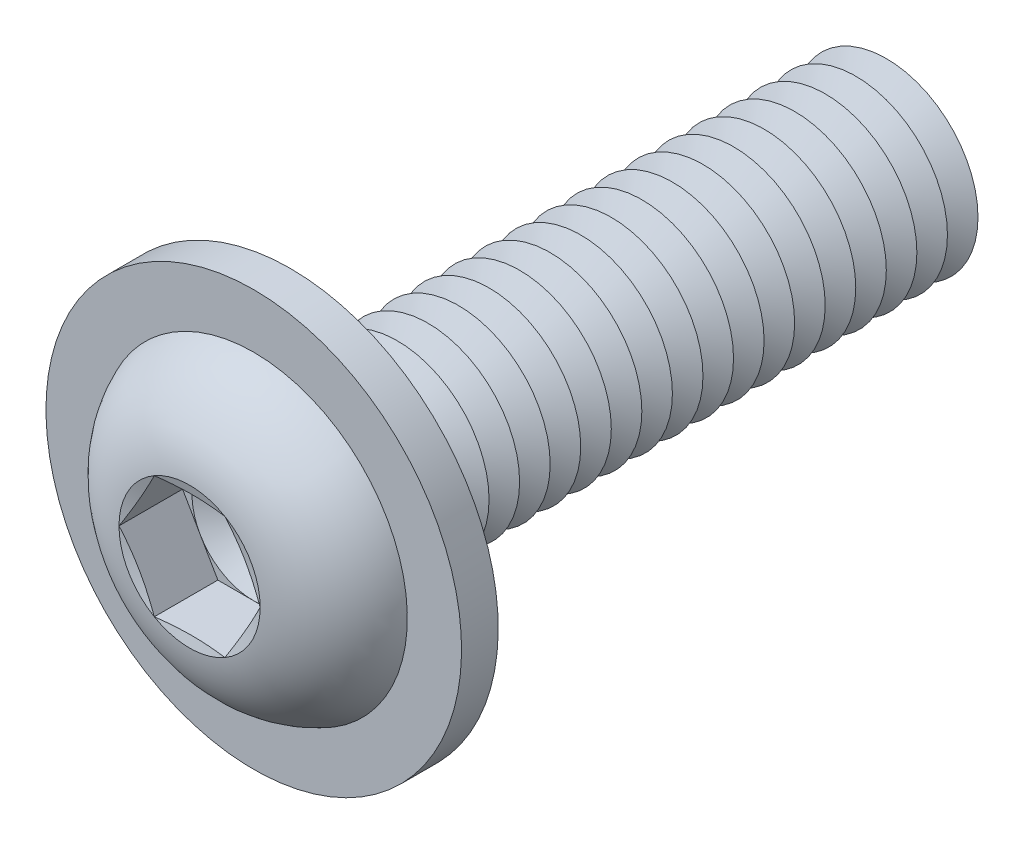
ISO-10303-21;
HEADER;
FILE_DESCRIPTION(('STEP AP214'),'2;1');
FILE_NAME('part.step','',(''),(''),'','','');
FILE_SCHEMA(('AUTOMOTIVE_DESIGN { 1 0 10303 214 1 1 1 1 }'));
ENDSEC;
DATA;
#1=APPLICATION_CONTEXT('core data for automotive mechanical design processes');
#2=APPLICATION_PROTOCOL_DEFINITION('international standard','automotive_design',2000,#1);
#3=PRODUCT_CONTEXT('',#1,'mechanical');
#4=PRODUCT('Part','Part','',(#3));
#5=PRODUCT_RELATED_PRODUCT_CATEGORY('part','',(#4));
#6=PRODUCT_DEFINITION_FORMATION('','',#4);
#7=PRODUCT_DEFINITION_CONTEXT('part definition',#1,'design');
#8=PRODUCT_DEFINITION('design','',#6,#7);
#9=PRODUCT_DEFINITION_SHAPE('','',#8);
#10=(LENGTH_UNIT() NAMED_UNIT(*) SI_UNIT(.MILLI.,.METRE.));
#11=(NAMED_UNIT(*) PLANE_ANGLE_UNIT() SI_UNIT($,.RADIAN.));
#12=(NAMED_UNIT(*) SI_UNIT($,.STERADIAN.) SOLID_ANGLE_UNIT());
#13=UNCERTAINTY_MEASURE_WITH_UNIT(LENGTH_MEASURE(1.E-05),#10,'distance_accuracy_value','');
#14=(GEOMETRIC_REPRESENTATION_CONTEXT(3) GLOBAL_UNCERTAINTY_ASSIGNED_CONTEXT((#13)) GLOBAL_UNIT_ASSIGNED_CONTEXT((#10,
#11,#12)) REPRESENTATION_CONTEXT('',''));
#15=CARTESIAN_POINT('',(0.,0.,0.));
#16=DIRECTION('',(0.,0.,1.));
#17=DIRECTION('',(1.,0.,0.));
#18=AXIS2_PLACEMENT_3D('',#15,#16,#17);
#19=CARTESIAN_POINT('',(0.,0.,-16.5));
#20=DIRECTION('',(0.,0.,1.));
#21=DIRECTION('',(1.,0.,0.));
#22=AXIS2_PLACEMENT_3D('',#19,#20,#21);
#23=CONICAL_SURFACE('',#22,3.00000000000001,1.0471975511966);
#24=CARTESIAN_POINT('',(0.,0.,-17.));
#25=DIRECTION('',(0.,0.,1.));
#26=DIRECTION('',(1.,0.,0.));
#27=AXIS2_PLACEMENT_3D('',#24,#25,#26);
#28=CIRCLE('',#27,2.13397459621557);
#29=CARTESIAN_POINT('',(2.13397459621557,0.,-17.));
#30=VERTEX_POINT('',#29);
#31=EDGE_CURVE('E369',#30,#30,#28,.T.);
#32=ORIENTED_EDGE('',*,*,#31,.T.);
#33=EDGE_LOOP('',(#32));
#34=FACE_BOUND('',#33,.T.);
#35=CARTESIAN_POINT('',(0.,0.,-16.5));
#36=DIRECTION('',(0.,0.,1.));
#37=DIRECTION('',(1.,0.,0.));
#38=AXIS2_PLACEMENT_3D('',#35,#36,#37);
#39=CIRCLE('',#38,3.00000000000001);
#40=CARTESIAN_POINT('',(3.00000000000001,0.,-16.5));
#41=VERTEX_POINT('',#40);
#42=EDGE_CURVE('E365',#41,#41,#39,.T.);
#43=ORIENTED_EDGE('',*,*,#42,.F.);
#44=EDGE_LOOP('',(#43));
#45=FACE_BOUND('',#44,.T.);
#46=ADVANCED_FACE('F39',(#34,#45),#23,.T.);
#47=CARTESIAN_POINT('',(0.,0.,-17.));
#48=DIRECTION('',(0.,0.,-1.));
#49=DIRECTION('',(-1.,0.,0.));
#50=AXIS2_PLACEMENT_3D('',#47,#48,#49);
#51=CONICAL_SURFACE('',#50,2.13397459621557,1.0471975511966);
#52=CARTESIAN_POINT('',(0.,0.,-17.5));
#53=DIRECTION('',(0.,0.,1.));
#54=DIRECTION('',(1.,0.,0.));
#55=AXIS2_PLACEMENT_3D('',#52,#53,#54);
#56=CIRCLE('',#55,3.00000000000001);
#57=CARTESIAN_POINT('',(3.00000000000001,0.,-17.5));
#58=VERTEX_POINT('',#57);
#59=EDGE_CURVE('E373',#58,#58,#56,.T.);
#60=ORIENTED_EDGE('',*,*,#59,.T.);
#61=EDGE_LOOP('',(#60));
#62=FACE_BOUND('',#61,.T.);
#63=ORIENTED_EDGE('',*,*,#31,.F.);
#64=EDGE_LOOP('',(#63));
#65=FACE_BOUND('',#64,.T.);
#66=ADVANCED_FACE('F492',(#62,#65),#51,.T.);
#67=CARTESIAN_POINT('',(0.,3.00000000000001,-20.));
#68=DIRECTION('',(0.,0.,-1.));
#69=DIRECTION('',(-1.,0.,0.));
#70=AXIS2_PLACEMENT_3D('',#67,#68,#69);
#71=PLANE('',#70);
#72=CARTESIAN_POINT('',(0.,0.,-20.));
#73=DIRECTION('',(0.,0.,1.));
#74=DIRECTION('',(1.,0.,0.));
#75=AXIS2_PLACEMENT_3D('',#72,#73,#74);
#76=CIRCLE('',#75,2.13397459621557);
#77=CARTESIAN_POINT('',(2.13397459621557,0.,-20.));
#78=VERTEX_POINT('',#77);
#79=EDGE_CURVE('E393',#78,#78,#76,.T.);
#80=ORIENTED_EDGE('',*,*,#79,.F.);
#81=EDGE_LOOP('',(#80));
#82=FACE_BOUND('',#81,.T.);
#83=ADVANCED_FACE('F498',(#82),#71,.T.);
#84=CARTESIAN_POINT('',(0.,0.,-19.5));
#85=DIRECTION('',(0.,0.,1.));
#86=DIRECTION('',(1.,0.,0.));
#87=AXIS2_PLACEMENT_3D('',#84,#85,#86);
#88=CONICAL_SURFACE('',#87,3.00000000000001,1.0471975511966);
#89=ORIENTED_EDGE('',*,*,#79,.T.);
#90=EDGE_LOOP('',(#89));
#91=FACE_BOUND('',#90,.T.);
#92=CARTESIAN_POINT('',(0.,0.,-19.5));
#93=DIRECTION('',(0.,0.,1.));
#94=DIRECTION('',(1.,0.,0.));
#95=AXIS2_PLACEMENT_3D('',#92,#93,#94);
#96=CIRCLE('',#95,3.00000000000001);
#97=CARTESIAN_POINT('',(3.00000000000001,0.,-19.5));
#98=VERTEX_POINT('',#97);
#99=EDGE_CURVE('E389',#98,#98,#96,.T.);
#100=ORIENTED_EDGE('',*,*,#99,.F.);
#101=EDGE_LOOP('',(#100));
#102=FACE_BOUND('',#101,.T.);
#103=ADVANCED_FACE('F517',(#91,#102),#88,.T.);
#104=CARTESIAN_POINT('',(0.,0.,-19.));
#105=DIRECTION('',(0.,0.,-1.));
#106=DIRECTION('',(-1.,0.,0.));
#107=AXIS2_PLACEMENT_3D('',#104,#105,#106);
#108=CONICAL_SURFACE('',#107,2.13397459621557,1.0471975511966);
#109=ORIENTED_EDGE('',*,*,#99,.T.);
#110=EDGE_LOOP('',(#109));
#111=FACE_BOUND('',#110,.T.);
#112=CARTESIAN_POINT('',(0.,0.,-19.));
#113=DIRECTION('',(0.,0.,1.));
#114=DIRECTION('',(1.,0.,0.));
#115=AXIS2_PLACEMENT_3D('',#112,#113,#114);
#116=CIRCLE('',#115,2.13397459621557);
#117=CARTESIAN_POINT('',(2.13397459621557,0.,-19.));
#118=VERTEX_POINT('',#117);
#119=EDGE_CURVE('E385',#118,#118,#116,.T.);
#120=ORIENTED_EDGE('',*,*,#119,.F.);
#121=EDGE_LOOP('',(#120));
#122=FACE_BOUND('',#121,.T.);
#123=ADVANCED_FACE('F514',(#111,#122),#108,.T.);
#124=CARTESIAN_POINT('',(0.,0.,-18.5));
#125=DIRECTION('',(0.,0.,1.));
#126=DIRECTION('',(1.,0.,0.));
#127=AXIS2_PLACEMENT_3D('',#124,#125,#126);
#128=CONICAL_SURFACE('',#127,3.00000000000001,1.0471975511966);
#129=ORIENTED_EDGE('',*,*,#119,.T.);
#130=EDGE_LOOP('',(#129));
#131=FACE_BOUND('',#130,.T.);
#132=CARTESIAN_POINT('',(0.,0.,-18.5));
#133=DIRECTION('',(0.,0.,1.));
#134=DIRECTION('',(1.,0.,0.));
#135=AXIS2_PLACEMENT_3D('',#132,#133,#134);
#136=CIRCLE('',#135,3.00000000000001);
#137=CARTESIAN_POINT('',(3.00000000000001,0.,-18.5));
#138=VERTEX_POINT('',#137);
#139=EDGE_CURVE('E381',#138,#138,#136,.T.);
#140=ORIENTED_EDGE('',*,*,#139,.F.);
#141=EDGE_LOOP('',(#140));
#142=FACE_BOUND('',#141,.T.);
#143=ADVANCED_FACE('F508',(#131,#142),#128,.T.);
#144=CARTESIAN_POINT('',(0.,0.,-18.));
#145=DIRECTION('',(0.,0.,-1.));
#146=DIRECTION('',(-1.,0.,0.));
#147=AXIS2_PLACEMENT_3D('',#144,#145,#146);
#148=CONICAL_SURFACE('',#147,2.13397459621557,1.0471975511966);
#149=ORIENTED_EDGE('',*,*,#139,.T.);
#150=EDGE_LOOP('',(#149));
#151=FACE_BOUND('',#150,.T.);
#152=CARTESIAN_POINT('',(0.,0.,-18.));
#153=DIRECTION('',(0.,0.,1.));
#154=DIRECTION('',(1.,0.,0.));
#155=AXIS2_PLACEMENT_3D('',#152,#153,#154);
#156=CIRCLE('',#155,2.13397459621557);
#157=CARTESIAN_POINT('',(2.13397459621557,0.,-18.));
#158=VERTEX_POINT('',#157);
#159=EDGE_CURVE('E377',#158,#158,#156,.T.);
#160=ORIENTED_EDGE('',*,*,#159,.F.);
#161=EDGE_LOOP('',(#160));
#162=FACE_BOUND('',#161,.T.);
#163=ADVANCED_FACE('F504',(#151,#162),#148,.T.);
#164=CARTESIAN_POINT('',(0.,0.,-17.5));
#165=DIRECTION('',(0.,0.,1.));
#166=DIRECTION('',(1.,0.,0.));
#167=AXIS2_PLACEMENT_3D('',#164,#165,#166);
#168=CONICAL_SURFACE('',#167,3.00000000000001,1.0471975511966);
#169=ORIENTED_EDGE('',*,*,#159,.T.);
#170=EDGE_LOOP('',(#169));
#171=FACE_BOUND('',#170,.T.);
#172=ORIENTED_EDGE('',*,*,#59,.F.);
#173=EDGE_LOOP('',(#172));
#174=FACE_BOUND('',#173,.T.);
#175=ADVANCED_FACE('F507',(#171,#174),#168,.T.);
#176=CARTESIAN_POINT('',(0.,0.,-15.5));
#177=DIRECTION('',(0.,0.,1.));
#178=DIRECTION('',(1.,0.,0.));
#179=AXIS2_PLACEMENT_3D('',#176,#177,#178);
#180=CONICAL_SURFACE('',#179,3.00000000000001,1.0471975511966);
#181=CARTESIAN_POINT('',(0.,0.,-16.));
#182=DIRECTION('',(0.,0.,1.));
#183=DIRECTION('',(1.,0.,0.));
#184=AXIS2_PLACEMENT_3D('',#181,#182,#183);
#185=CIRCLE('',#184,2.13397459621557);
#186=CARTESIAN_POINT('',(2.13397459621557,0.,-16.));
#187=VERTEX_POINT('',#186);
#188=EDGE_CURVE('E361',#187,#187,#185,.T.);
#189=ORIENTED_EDGE('',*,*,#188,.T.);
#190=EDGE_LOOP('',(#189));
#191=FACE_BOUND('',#190,.T.);
#192=CARTESIAN_POINT('',(0.,0.,-15.5));
#193=DIRECTION('',(0.,0.,1.));
#194=DIRECTION('',(1.,0.,0.));
#195=AXIS2_PLACEMENT_3D('',#192,#193,#194);
#196=CIRCLE('',#195,3.00000000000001);
#197=CARTESIAN_POINT('',(3.00000000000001,0.,-15.5));
#198=VERTEX_POINT('',#197);
#199=EDGE_CURVE('E357',#198,#198,#196,.T.);
#200=ORIENTED_EDGE('',*,*,#199,.F.);
#201=EDGE_LOOP('',(#200));
#202=FACE_BOUND('',#201,.T.);
#203=ADVANCED_FACE('F512',(#191,#202),#180,.T.);
#204=CARTESIAN_POINT('',(0.,0.,-16.));
#205=DIRECTION('',(0.,0.,-1.));
#206=DIRECTION('',(-1.,0.,0.));
#207=AXIS2_PLACEMENT_3D('',#204,#205,#206);
#208=CONICAL_SURFACE('',#207,2.13397459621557,1.0471975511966);
#209=ORIENTED_EDGE('',*,*,#42,.T.);
#210=EDGE_LOOP('',(#209));
#211=FACE_BOUND('',#210,.T.);
#212=ORIENTED_EDGE('',*,*,#188,.F.);
#213=EDGE_LOOP('',(#212));
#214=FACE_BOUND('',#213,.T.);
#215=ADVANCED_FACE('F563',(#211,#214),#208,.T.);
#216=CARTESIAN_POINT('',(0.,0.,-14.5));
#217=DIRECTION('',(0.,0.,1.));
#218=DIRECTION('',(1.,0.,0.));
#219=AXIS2_PLACEMENT_3D('',#216,#217,#218);
#220=CONICAL_SURFACE('',#219,3.00000000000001,1.0471975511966);
#221=CARTESIAN_POINT('',(0.,0.,-15.));
#222=DIRECTION('',(0.,0.,1.));
#223=DIRECTION('',(1.,0.,0.));
#224=AXIS2_PLACEMENT_3D('',#221,#222,#223);
#225=CIRCLE('',#224,2.13397459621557);
#226=CARTESIAN_POINT('',(2.13397459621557,0.,-15.));
#227=VERTEX_POINT('',#226);
#228=EDGE_CURVE('E353',#227,#227,#225,.T.);
#229=ORIENTED_EDGE('',*,*,#228,.T.);
#230=EDGE_LOOP('',(#229));
#231=FACE_BOUND('',#230,.T.);
#232=CARTESIAN_POINT('',(0.,0.,-14.5));
#233=DIRECTION('',(0.,0.,1.));
#234=DIRECTION('',(1.,0.,0.));
#235=AXIS2_PLACEMENT_3D('',#232,#233,#234);
#236=CIRCLE('',#235,3.00000000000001);
#237=CARTESIAN_POINT('',(3.00000000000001,0.,-14.5));
#238=VERTEX_POINT('',#237);
#239=EDGE_CURVE('E349',#238,#238,#236,.T.);
#240=ORIENTED_EDGE('',*,*,#239,.F.);
#241=EDGE_LOOP('',(#240));
#242=FACE_BOUND('',#241,.T.);
#243=ADVANCED_FACE('F569',(#231,#242),#220,.T.);
#244=CARTESIAN_POINT('',(0.,0.,-15.));
#245=DIRECTION('',(0.,0.,-1.));
#246=DIRECTION('',(-1.,0.,0.));
#247=AXIS2_PLACEMENT_3D('',#244,#245,#246);
#248=CONICAL_SURFACE('',#247,2.13397459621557,1.0471975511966);
#249=ORIENTED_EDGE('',*,*,#199,.T.);
#250=EDGE_LOOP('',(#249));
#251=FACE_BOUND('',#250,.T.);
#252=ORIENTED_EDGE('',*,*,#228,.F.);
#253=EDGE_LOOP('',(#252));
#254=FACE_BOUND('',#253,.T.);
#255=ADVANCED_FACE('F576',(#251,#254),#248,.T.);
#256=CARTESIAN_POINT('',(0.,0.,-13.5));
#257=DIRECTION('',(0.,0.,1.));
#258=DIRECTION('',(1.,0.,0.));
#259=AXIS2_PLACEMENT_3D('',#256,#257,#258);
#260=CONICAL_SURFACE('',#259,3.00000000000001,1.0471975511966);
#261=CARTESIAN_POINT('',(0.,0.,-14.));
#262=DIRECTION('',(0.,0.,1.));
#263=DIRECTION('',(1.,0.,0.));
#264=AXIS2_PLACEMENT_3D('',#261,#262,#263);
#265=CIRCLE('',#264,2.13397459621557);
#266=CARTESIAN_POINT('',(2.13397459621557,0.,-14.));
#267=VERTEX_POINT('',#266);
#268=EDGE_CURVE('E345',#267,#267,#265,.T.);
#269=ORIENTED_EDGE('',*,*,#268,.T.);
#270=EDGE_LOOP('',(#269));
#271=FACE_BOUND('',#270,.T.);
#272=CARTESIAN_POINT('',(0.,0.,-13.5));
#273=DIRECTION('',(0.,0.,1.));
#274=DIRECTION('',(1.,0.,0.));
#275=AXIS2_PLACEMENT_3D('',#272,#273,#274);
#276=CIRCLE('',#275,3.00000000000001);
#277=CARTESIAN_POINT('',(3.00000000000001,0.,-13.5));
#278=VERTEX_POINT('',#277);
#279=EDGE_CURVE('E341',#278,#278,#276,.T.);
#280=ORIENTED_EDGE('',*,*,#279,.F.);
#281=EDGE_LOOP('',(#280));
#282=FACE_BOUND('',#281,.T.);
#283=ADVANCED_FACE('F583',(#271,#282),#260,.T.);
#284=CARTESIAN_POINT('',(0.,0.,-14.));
#285=DIRECTION('',(0.,0.,-1.));
#286=DIRECTION('',(-1.,0.,0.));
#287=AXIS2_PLACEMENT_3D('',#284,#285,#286);
#288=CONICAL_SURFACE('',#287,2.13397459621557,1.0471975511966);
#289=ORIENTED_EDGE('',*,*,#239,.T.);
#290=EDGE_LOOP('',(#289));
#291=FACE_BOUND('',#290,.T.);
#292=ORIENTED_EDGE('',*,*,#268,.F.);
#293=EDGE_LOOP('',(#292));
#294=FACE_BOUND('',#293,.T.);
#295=ADVANCED_FACE('F590',(#291,#294),#288,.T.);
#296=CARTESIAN_POINT('',(0.,0.,-12.5));
#297=DIRECTION('',(0.,0.,1.));
#298=DIRECTION('',(1.,0.,0.));
#299=AXIS2_PLACEMENT_3D('',#296,#297,#298);
#300=CONICAL_SURFACE('',#299,3.00000000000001,1.0471975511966);
#301=CARTESIAN_POINT('',(0.,0.,-13.));
#302=DIRECTION('',(0.,0.,1.));
#303=DIRECTION('',(1.,0.,0.));
#304=AXIS2_PLACEMENT_3D('',#301,#302,#303);
#305=CIRCLE('',#304,2.13397459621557);
#306=CARTESIAN_POINT('',(2.13397459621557,0.,-13.));
#307=VERTEX_POINT('',#306);
#308=EDGE_CURVE('E337',#307,#307,#305,.T.);
#309=ORIENTED_EDGE('',*,*,#308,.T.);
#310=EDGE_LOOP('',(#309));
#311=FACE_BOUND('',#310,.T.);
#312=CARTESIAN_POINT('',(0.,0.,-12.5));
#313=DIRECTION('',(0.,0.,1.));
#314=DIRECTION('',(1.,0.,0.));
#315=AXIS2_PLACEMENT_3D('',#312,#313,#314);
#316=CIRCLE('',#315,3.00000000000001);
#317=CARTESIAN_POINT('',(3.00000000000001,0.,-12.5));
#318=VERTEX_POINT('',#317);
#319=EDGE_CURVE('E333',#318,#318,#316,.T.);
#320=ORIENTED_EDGE('',*,*,#319,.F.);
#321=EDGE_LOOP('',(#320));
#322=FACE_BOUND('',#321,.T.);
#323=ADVANCED_FACE('F597',(#311,#322),#300,.T.);
#324=CARTESIAN_POINT('',(0.,0.,-13.));
#325=DIRECTION('',(0.,0.,-1.));
#326=DIRECTION('',(-1.,0.,0.));
#327=AXIS2_PLACEMENT_3D('',#324,#325,#326);
#328=CONICAL_SURFACE('',#327,2.13397459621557,1.0471975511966);
#329=ORIENTED_EDGE('',*,*,#279,.T.);
#330=EDGE_LOOP('',(#329));
#331=FACE_BOUND('',#330,.T.);
#332=ORIENTED_EDGE('',*,*,#308,.F.);
#333=EDGE_LOOP('',(#332));
#334=FACE_BOUND('',#333,.T.);
#335=ADVANCED_FACE('F604',(#331,#334),#328,.T.);
#336=CARTESIAN_POINT('',(0.,0.,-11.5));
#337=DIRECTION('',(0.,0.,1.));
#338=DIRECTION('',(1.,0.,0.));
#339=AXIS2_PLACEMENT_3D('',#336,#337,#338);
#340=CONICAL_SURFACE('',#339,3.00000000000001,1.0471975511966);
#341=CARTESIAN_POINT('',(0.,0.,-12.));
#342=DIRECTION('',(0.,0.,1.));
#343=DIRECTION('',(1.,0.,0.));
#344=AXIS2_PLACEMENT_3D('',#341,#342,#343);
#345=CIRCLE('',#344,2.13397459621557);
#346=CARTESIAN_POINT('',(2.13397459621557,0.,-12.));
#347=VERTEX_POINT('',#346);
#348=EDGE_CURVE('E329',#347,#347,#345,.T.);
#349=ORIENTED_EDGE('',*,*,#348,.T.);
#350=EDGE_LOOP('',(#349));
#351=FACE_BOUND('',#350,.T.);
#352=CARTESIAN_POINT('',(0.,0.,-11.5));
#353=DIRECTION('',(0.,0.,1.));
#354=DIRECTION('',(1.,0.,0.));
#355=AXIS2_PLACEMENT_3D('',#352,#353,#354);
#356=CIRCLE('',#355,3.00000000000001);
#357=CARTESIAN_POINT('',(3.00000000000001,0.,-11.5));
#358=VERTEX_POINT('',#357);
#359=EDGE_CURVE('E325',#358,#358,#356,.T.);
#360=ORIENTED_EDGE('',*,*,#359,.F.);
#361=EDGE_LOOP('',(#360));
#362=FACE_BOUND('',#361,.T.);
#363=ADVANCED_FACE('F611',(#351,#362),#340,.T.);
#364=CARTESIAN_POINT('',(0.,0.,-12.));
#365=DIRECTION('',(0.,0.,-1.));
#366=DIRECTION('',(-1.,0.,0.));
#367=AXIS2_PLACEMENT_3D('',#364,#365,#366);
#368=CONICAL_SURFACE('',#367,2.13397459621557,1.0471975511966);
#369=ORIENTED_EDGE('',*,*,#319,.T.);
#370=EDGE_LOOP('',(#369));
#371=FACE_BOUND('',#370,.T.);
#372=ORIENTED_EDGE('',*,*,#348,.F.);
#373=EDGE_LOOP('',(#372));
#374=FACE_BOUND('',#373,.T.);
#375=ADVANCED_FACE('F618',(#371,#374),#368,.T.);
#376=CARTESIAN_POINT('',(0.,0.,-10.5));
#377=DIRECTION('',(0.,0.,1.));
#378=DIRECTION('',(1.,0.,0.));
#379=AXIS2_PLACEMENT_3D('',#376,#377,#378);
#380=CONICAL_SURFACE('',#379,3.00000000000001,1.0471975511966);
#381=CARTESIAN_POINT('',(0.,0.,-11.));
#382=DIRECTION('',(0.,0.,1.));
#383=DIRECTION('',(1.,0.,0.));
#384=AXIS2_PLACEMENT_3D('',#381,#382,#383);
#385=CIRCLE('',#384,2.13397459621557);
#386=CARTESIAN_POINT('',(2.13397459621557,0.,-11.));
#387=VERTEX_POINT('',#386);
#388=EDGE_CURVE('E321',#387,#387,#385,.T.);
#389=ORIENTED_EDGE('',*,*,#388,.T.);
#390=EDGE_LOOP('',(#389));
#391=FACE_BOUND('',#390,.T.);
#392=CARTESIAN_POINT('',(0.,0.,-10.5));
#393=DIRECTION('',(0.,0.,1.));
#394=DIRECTION('',(1.,0.,0.));
#395=AXIS2_PLACEMENT_3D('',#392,#393,#394);
#396=CIRCLE('',#395,3.00000000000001);
#397=CARTESIAN_POINT('',(3.00000000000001,0.,-10.5));
#398=VERTEX_POINT('',#397);
#399=EDGE_CURVE('E317',#398,#398,#396,.T.);
#400=ORIENTED_EDGE('',*,*,#399,.F.);
#401=EDGE_LOOP('',(#400));
#402=FACE_BOUND('',#401,.T.);
#403=ADVANCED_FACE('F625',(#391,#402),#380,.T.);
#404=CARTESIAN_POINT('',(0.,0.,-11.));
#405=DIRECTION('',(0.,0.,-1.));
#406=DIRECTION('',(-1.,0.,0.));
#407=AXIS2_PLACEMENT_3D('',#404,#405,#406);
#408=CONICAL_SURFACE('',#407,2.13397459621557,1.0471975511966);
#409=ORIENTED_EDGE('',*,*,#359,.T.);
#410=EDGE_LOOP('',(#409));
#411=FACE_BOUND('',#410,.T.);
#412=ORIENTED_EDGE('',*,*,#388,.F.);
#413=EDGE_LOOP('',(#412));
#414=FACE_BOUND('',#413,.T.);
#415=ADVANCED_FACE('F632',(#411,#414),#408,.T.);
#416=CARTESIAN_POINT('',(0.,0.,-9.5));
#417=DIRECTION('',(0.,0.,1.));
#418=DIRECTION('',(1.,0.,0.));
#419=AXIS2_PLACEMENT_3D('',#416,#417,#418);
#420=CONICAL_SURFACE('',#419,3.00000000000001,1.0471975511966);
#421=CARTESIAN_POINT('',(0.,0.,-10.));
#422=DIRECTION('',(0.,0.,1.));
#423=DIRECTION('',(1.,0.,0.));
#424=AXIS2_PLACEMENT_3D('',#421,#422,#423);
#425=CIRCLE('',#424,2.13397459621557);
#426=CARTESIAN_POINT('',(2.13397459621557,0.,-10.));
#427=VERTEX_POINT('',#426);
#428=EDGE_CURVE('E313',#427,#427,#425,.T.);
#429=ORIENTED_EDGE('',*,*,#428,.T.);
#430=EDGE_LOOP('',(#429));
#431=FACE_BOUND('',#430,.T.);
#432=CARTESIAN_POINT('',(0.,0.,-9.5));
#433=DIRECTION('',(0.,0.,1.));
#434=DIRECTION('',(1.,0.,0.));
#435=AXIS2_PLACEMENT_3D('',#432,#433,#434);
#436=CIRCLE('',#435,3.00000000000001);
#437=CARTESIAN_POINT('',(3.00000000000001,0.,-9.5));
#438=VERTEX_POINT('',#437);
#439=EDGE_CURVE('E309',#438,#438,#436,.T.);
#440=ORIENTED_EDGE('',*,*,#439,.F.);
#441=EDGE_LOOP('',(#440));
#442=FACE_BOUND('',#441,.T.);
#443=ADVANCED_FACE('F639',(#431,#442),#420,.T.);
#444=CARTESIAN_POINT('',(0.,0.,-10.));
#445=DIRECTION('',(0.,0.,-1.));
#446=DIRECTION('',(-1.,0.,0.));
#447=AXIS2_PLACEMENT_3D('',#444,#445,#446);
#448=CONICAL_SURFACE('',#447,2.13397459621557,1.0471975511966);
#449=ORIENTED_EDGE('',*,*,#399,.T.);
#450=EDGE_LOOP('',(#449));
#451=FACE_BOUND('',#450,.T.);
#452=ORIENTED_EDGE('',*,*,#428,.F.);
#453=EDGE_LOOP('',(#452));
#454=FACE_BOUND('',#453,.T.);
#455=ADVANCED_FACE('F646',(#451,#454),#448,.T.);
#456=CARTESIAN_POINT('',(0.,0.,-8.5));
#457=DIRECTION('',(0.,0.,1.));
#458=DIRECTION('',(1.,0.,0.));
#459=AXIS2_PLACEMENT_3D('',#456,#457,#458);
#460=CONICAL_SURFACE('',#459,3.00000000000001,1.0471975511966);
#461=CARTESIAN_POINT('',(0.,0.,-9.));
#462=DIRECTION('',(0.,0.,1.));
#463=DIRECTION('',(1.,0.,0.));
#464=AXIS2_PLACEMENT_3D('',#461,#462,#463);
#465=CIRCLE('',#464,2.13397459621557);
#466=CARTESIAN_POINT('',(2.13397459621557,0.,-9.));
#467=VERTEX_POINT('',#466);
#468=EDGE_CURVE('E305',#467,#467,#465,.T.);
#469=ORIENTED_EDGE('',*,*,#468,.T.);
#470=EDGE_LOOP('',(#469));
#471=FACE_BOUND('',#470,.T.);
#472=CARTESIAN_POINT('',(0.,0.,-8.5));
#473=DIRECTION('',(0.,0.,1.));
#474=DIRECTION('',(1.,0.,0.));
#475=AXIS2_PLACEMENT_3D('',#472,#473,#474);
#476=CIRCLE('',#475,3.00000000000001);
#477=CARTESIAN_POINT('',(3.00000000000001,0.,-8.5));
#478=VERTEX_POINT('',#477);
#479=EDGE_CURVE('E301',#478,#478,#476,.T.);
#480=ORIENTED_EDGE('',*,*,#479,.F.);
#481=EDGE_LOOP('',(#480));
#482=FACE_BOUND('',#481,.T.);
#483=ADVANCED_FACE('F653',(#471,#482),#460,.T.);
#484=CARTESIAN_POINT('',(0.,0.,-9.));
#485=DIRECTION('',(0.,0.,-1.));
#486=DIRECTION('',(-1.,0.,0.));
#487=AXIS2_PLACEMENT_3D('',#484,#485,#486);
#488=CONICAL_SURFACE('',#487,2.13397459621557,1.0471975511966);
#489=ORIENTED_EDGE('',*,*,#439,.T.);
#490=EDGE_LOOP('',(#489));
#491=FACE_BOUND('',#490,.T.);
#492=ORIENTED_EDGE('',*,*,#468,.F.);
#493=EDGE_LOOP('',(#492));
#494=FACE_BOUND('',#493,.T.);
#495=ADVANCED_FACE('F660',(#491,#494),#488,.T.);
#496=CARTESIAN_POINT('',(0.,0.,-7.5));
#497=DIRECTION('',(0.,0.,1.));
#498=DIRECTION('',(1.,0.,0.));
#499=AXIS2_PLACEMENT_3D('',#496,#497,#498);
#500=CONICAL_SURFACE('',#499,3.00000000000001,1.0471975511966);
#501=CARTESIAN_POINT('',(0.,0.,-8.));
#502=DIRECTION('',(0.,0.,1.));
#503=DIRECTION('',(1.,0.,0.));
#504=AXIS2_PLACEMENT_3D('',#501,#502,#503);
#505=CIRCLE('',#504,2.13397459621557);
#506=CARTESIAN_POINT('',(2.13397459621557,0.,-8.));
#507=VERTEX_POINT('',#506);
#508=EDGE_CURVE('E297',#507,#507,#505,.T.);
#509=ORIENTED_EDGE('',*,*,#508,.T.);
#510=EDGE_LOOP('',(#509));
#511=FACE_BOUND('',#510,.T.);
#512=CARTESIAN_POINT('',(0.,0.,-7.5));
#513=DIRECTION('',(0.,0.,1.));
#514=DIRECTION('',(1.,0.,0.));
#515=AXIS2_PLACEMENT_3D('',#512,#513,#514);
#516=CIRCLE('',#515,3.00000000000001);
#517=CARTESIAN_POINT('',(3.00000000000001,0.,-7.5));
#518=VERTEX_POINT('',#517);
#519=EDGE_CURVE('E293',#518,#518,#516,.T.);
#520=ORIENTED_EDGE('',*,*,#519,.F.);
#521=EDGE_LOOP('',(#520));
#522=FACE_BOUND('',#521,.T.);
#523=ADVANCED_FACE('F667',(#511,#522),#500,.T.);
#524=CARTESIAN_POINT('',(0.,0.,-8.));
#525=DIRECTION('',(0.,0.,-1.));
#526=DIRECTION('',(-1.,0.,0.));
#527=AXIS2_PLACEMENT_3D('',#524,#525,#526);
#528=CONICAL_SURFACE('',#527,2.13397459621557,1.0471975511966);
#529=ORIENTED_EDGE('',*,*,#479,.T.);
#530=EDGE_LOOP('',(#529));
#531=FACE_BOUND('',#530,.T.);
#532=ORIENTED_EDGE('',*,*,#508,.F.);
#533=EDGE_LOOP('',(#532));
#534=FACE_BOUND('',#533,.T.);
#535=ADVANCED_FACE('F674',(#531,#534),#528,.T.);
#536=CARTESIAN_POINT('',(0.,0.,-6.5));
#537=DIRECTION('',(0.,0.,1.));
#538=DIRECTION('',(1.,0.,0.));
#539=AXIS2_PLACEMENT_3D('',#536,#537,#538);
#540=CONICAL_SURFACE('',#539,3.00000000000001,1.0471975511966);
#541=CARTESIAN_POINT('',(0.,0.,-7.));
#542=DIRECTION('',(0.,0.,1.));
#543=DIRECTION('',(1.,0.,0.));
#544=AXIS2_PLACEMENT_3D('',#541,#542,#543);
#545=CIRCLE('',#544,2.13397459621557);
#546=CARTESIAN_POINT('',(2.13397459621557,0.,-7.));
#547=VERTEX_POINT('',#546);
#548=EDGE_CURVE('E289',#547,#547,#545,.T.);
#549=ORIENTED_EDGE('',*,*,#548,.T.);
#550=EDGE_LOOP('',(#549));
#551=FACE_BOUND('',#550,.T.);
#552=CARTESIAN_POINT('',(0.,0.,-6.5));
#553=DIRECTION('',(0.,0.,1.));
#554=DIRECTION('',(1.,0.,0.));
#555=AXIS2_PLACEMENT_3D('',#552,#553,#554);
#556=CIRCLE('',#555,3.00000000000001);
#557=CARTESIAN_POINT('',(3.00000000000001,0.,-6.5));
#558=VERTEX_POINT('',#557);
#559=EDGE_CURVE('E285',#558,#558,#556,.T.);
#560=ORIENTED_EDGE('',*,*,#559,.F.);
#561=EDGE_LOOP('',(#560));
#562=FACE_BOUND('',#561,.T.);
#563=ADVANCED_FACE('F681',(#551,#562),#540,.T.);
#564=CARTESIAN_POINT('',(0.,0.,-7.));
#565=DIRECTION('',(0.,0.,-1.));
#566=DIRECTION('',(-1.,0.,0.));
#567=AXIS2_PLACEMENT_3D('',#564,#565,#566);
#568=CONICAL_SURFACE('',#567,2.13397459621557,1.0471975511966);
#569=ORIENTED_EDGE('',*,*,#519,.T.);
#570=EDGE_LOOP('',(#569));
#571=FACE_BOUND('',#570,.T.);
#572=ORIENTED_EDGE('',*,*,#548,.F.);
#573=EDGE_LOOP('',(#572));
#574=FACE_BOUND('',#573,.T.);
#575=ADVANCED_FACE('F688',(#571,#574),#568,.T.);
#576=CARTESIAN_POINT('',(0.,0.,-5.5));
#577=DIRECTION('',(0.,0.,1.));
#578=DIRECTION('',(1.,0.,0.));
#579=AXIS2_PLACEMENT_3D('',#576,#577,#578);
#580=CONICAL_SURFACE('',#579,3.00000000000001,1.0471975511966);
#581=CARTESIAN_POINT('',(0.,0.,-6.));
#582=DIRECTION('',(0.,0.,1.));
#583=DIRECTION('',(1.,0.,0.));
#584=AXIS2_PLACEMENT_3D('',#581,#582,#583);
#585=CIRCLE('',#584,2.13397459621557);
#586=CARTESIAN_POINT('',(2.13397459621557,0.,-6.));
#587=VERTEX_POINT('',#586);
#588=EDGE_CURVE('E281',#587,#587,#585,.T.);
#589=ORIENTED_EDGE('',*,*,#588,.T.);
#590=EDGE_LOOP('',(#589));
#591=FACE_BOUND('',#590,.T.);
#592=CARTESIAN_POINT('',(0.,0.,-5.5));
#593=DIRECTION('',(0.,0.,1.));
#594=DIRECTION('',(1.,0.,0.));
#595=AXIS2_PLACEMENT_3D('',#592,#593,#594);
#596=CIRCLE('',#595,3.00000000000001);
#597=CARTESIAN_POINT('',(3.00000000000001,0.,-5.5));
#598=VERTEX_POINT('',#597);
#599=EDGE_CURVE('E277',#598,#598,#596,.T.);
#600=ORIENTED_EDGE('',*,*,#599,.F.);
#601=EDGE_LOOP('',(#600));
#602=FACE_BOUND('',#601,.T.);
#603=ADVANCED_FACE('F695',(#591,#602),#580,.T.);
#604=CARTESIAN_POINT('',(0.,0.,-6.));
#605=DIRECTION('',(0.,0.,-1.));
#606=DIRECTION('',(-1.,0.,0.));
#607=AXIS2_PLACEMENT_3D('',#604,#605,#606);
#608=CONICAL_SURFACE('',#607,2.13397459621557,1.0471975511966);
#609=ORIENTED_EDGE('',*,*,#559,.T.);
#610=EDGE_LOOP('',(#609));
#611=FACE_BOUND('',#610,.T.);
#612=ORIENTED_EDGE('',*,*,#588,.F.);
#613=EDGE_LOOP('',(#612));
#614=FACE_BOUND('',#613,.T.);
#615=ADVANCED_FACE('F702',(#611,#614),#608,.T.);
#616=CARTESIAN_POINT('',(0.,0.,-4.5));
#617=DIRECTION('',(0.,0.,1.));
#618=DIRECTION('',(1.,0.,0.));
#619=AXIS2_PLACEMENT_3D('',#616,#617,#618);
#620=CONICAL_SURFACE('',#619,3.00000000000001,1.0471975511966);
#621=CARTESIAN_POINT('',(0.,0.,-5.));
#622=DIRECTION('',(0.,0.,1.));
#623=DIRECTION('',(1.,0.,0.));
#624=AXIS2_PLACEMENT_3D('',#621,#622,#623);
#625=CIRCLE('',#624,2.13397459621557);
#626=CARTESIAN_POINT('',(2.13397459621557,0.,-5.));
#627=VERTEX_POINT('',#626);
#628=EDGE_CURVE('E273',#627,#627,#625,.T.);
#629=ORIENTED_EDGE('',*,*,#628,.T.);
#630=EDGE_LOOP('',(#629));
#631=FACE_BOUND('',#630,.T.);
#632=CARTESIAN_POINT('',(0.,0.,-4.5));
#633=DIRECTION('',(0.,0.,1.));
#634=DIRECTION('',(1.,0.,0.));
#635=AXIS2_PLACEMENT_3D('',#632,#633,#634);
#636=CIRCLE('',#635,3.00000000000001);
#637=CARTESIAN_POINT('',(3.00000000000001,0.,-4.5));
#638=VERTEX_POINT('',#637);
#639=EDGE_CURVE('E269',#638,#638,#636,.T.);
#640=ORIENTED_EDGE('',*,*,#639,.F.);
#641=EDGE_LOOP('',(#640));
#642=FACE_BOUND('',#641,.T.);
#643=ADVANCED_FACE('F709',(#631,#642),#620,.T.);
#644=CARTESIAN_POINT('',(0.,0.,-5.));
#645=DIRECTION('',(0.,0.,-1.));
#646=DIRECTION('',(-1.,0.,0.));
#647=AXIS2_PLACEMENT_3D('',#644,#645,#646);
#648=CONICAL_SURFACE('',#647,2.13397459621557,1.0471975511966);
#649=ORIENTED_EDGE('',*,*,#599,.T.);
#650=EDGE_LOOP('',(#649));
#651=FACE_BOUND('',#650,.T.);
#652=ORIENTED_EDGE('',*,*,#628,.F.);
#653=EDGE_LOOP('',(#652));
#654=FACE_BOUND('',#653,.T.);
#655=ADVANCED_FACE('F716',(#651,#654),#648,.T.);
#656=CARTESIAN_POINT('',(0.,0.,-3.5));
#657=DIRECTION('',(0.,0.,1.));
#658=DIRECTION('',(1.,0.,0.));
#659=AXIS2_PLACEMENT_3D('',#656,#657,#658);
#660=CONICAL_SURFACE('',#659,3.00000000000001,1.0471975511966);
#661=CARTESIAN_POINT('',(0.,0.,-4.));
#662=DIRECTION('',(0.,0.,1.));
#663=DIRECTION('',(1.,0.,0.));
#664=AXIS2_PLACEMENT_3D('',#661,#662,#663);
#665=CIRCLE('',#664,2.13397459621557);
#666=CARTESIAN_POINT('',(2.13397459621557,0.,-4.));
#667=VERTEX_POINT('',#666);
#668=EDGE_CURVE('E266',#667,#667,#665,.T.);
#669=ORIENTED_EDGE('',*,*,#668,.T.);
#670=EDGE_LOOP('',(#669));
#671=FACE_BOUND('',#670,.T.);
#672=CARTESIAN_POINT('',(0.,0.,-3.5));
#673=DIRECTION('',(0.,0.,1.));
#674=DIRECTION('',(1.,0.,0.));
#675=AXIS2_PLACEMENT_3D('',#672,#673,#674);
#676=CIRCLE('',#675,3.00000000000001);
#677=CARTESIAN_POINT('',(3.00000000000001,0.,-3.5));
#678=VERTEX_POINT('',#677);
#679=EDGE_CURVE('E262',#678,#678,#676,.T.);
#680=ORIENTED_EDGE('',*,*,#679,.F.);
#681=EDGE_LOOP('',(#680));
#682=FACE_BOUND('',#681,.T.);
#683=ADVANCED_FACE('F723',(#671,#682),#660,.T.);
#684=CARTESIAN_POINT('',(0.,0.,-4.));
#685=DIRECTION('',(0.,0.,-1.));
#686=DIRECTION('',(-1.,0.,0.));
#687=AXIS2_PLACEMENT_3D('',#684,#685,#686);
#688=CONICAL_SURFACE('',#687,2.13397459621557,1.0471975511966);
#689=ORIENTED_EDGE('',*,*,#639,.T.);
#690=EDGE_LOOP('',(#689));
#691=FACE_BOUND('',#690,.T.);
#692=ORIENTED_EDGE('',*,*,#668,.F.);
#693=EDGE_LOOP('',(#692));
#694=FACE_BOUND('',#693,.T.);
#695=ADVANCED_FACE('F730',(#691,#694),#688,.T.);
#696=CARTESIAN_POINT('',(0.,0.,-2.5));
#697=DIRECTION('',(0.,0.,1.));
#698=DIRECTION('',(1.,0.,0.));
#699=AXIS2_PLACEMENT_3D('',#696,#697,#698);
#700=CONICAL_SURFACE('',#699,3.00000000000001,1.0471975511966);
#701=CARTESIAN_POINT('',(0.,0.,-3.));
#702=DIRECTION('',(0.,0.,1.));
#703=DIRECTION('',(1.,0.,0.));
#704=AXIS2_PLACEMENT_3D('',#701,#702,#703);
#705=CIRCLE('',#704,2.13397459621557);
#706=CARTESIAN_POINT('',(2.13397459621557,0.,-3.));
#707=VERTEX_POINT('',#706);
#708=EDGE_CURVE('E258',#707,#707,#705,.T.);
#709=ORIENTED_EDGE('',*,*,#708,.T.);
#710=EDGE_LOOP('',(#709));
#711=FACE_BOUND('',#710,.T.);
#712=CARTESIAN_POINT('',(0.,0.,-2.5));
#713=DIRECTION('',(0.,0.,1.));
#714=DIRECTION('',(1.,0.,0.));
#715=AXIS2_PLACEMENT_3D('',#712,#713,#714);
#716=CIRCLE('',#715,3.00000000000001);
#717=CARTESIAN_POINT('',(3.00000000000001,0.,-2.5));
#718=VERTEX_POINT('',#717);
#719=EDGE_CURVE('E254',#718,#718,#716,.T.);
#720=ORIENTED_EDGE('',*,*,#719,.F.);
#721=EDGE_LOOP('',(#720));
#722=FACE_BOUND('',#721,.T.);
#723=ADVANCED_FACE('F737',(#711,#722),#700,.T.);
#724=CARTESIAN_POINT('',(0.,0.,-3.));
#725=DIRECTION('',(0.,0.,-1.));
#726=DIRECTION('',(-1.,0.,0.));
#727=AXIS2_PLACEMENT_3D('',#724,#725,#726);
#728=CONICAL_SURFACE('',#727,2.13397459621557,1.0471975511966);
#729=ORIENTED_EDGE('',*,*,#679,.T.);
#730=EDGE_LOOP('',(#729));
#731=FACE_BOUND('',#730,.T.);
#732=ORIENTED_EDGE('',*,*,#708,.F.);
#733=EDGE_LOOP('',(#732));
#734=FACE_BOUND('',#733,.T.);
#735=ADVANCED_FACE('F744',(#731,#734),#728,.T.);
#736=CARTESIAN_POINT('',(0.,0.,-1.5));
#737=DIRECTION('',(0.,0.,1.));
#738=DIRECTION('',(1.,0.,0.));
#739=AXIS2_PLACEMENT_3D('',#736,#737,#738);
#740=CONICAL_SURFACE('',#739,3.00000000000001,1.0471975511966);
#741=CARTESIAN_POINT('',(0.,0.,-2.));
#742=DIRECTION('',(0.,0.,1.));
#743=DIRECTION('',(1.,0.,0.));
#744=AXIS2_PLACEMENT_3D('',#741,#742,#743);
#745=CIRCLE('',#744,2.13397459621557);
#746=CARTESIAN_POINT('',(2.13397459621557,0.,-2.));
#747=VERTEX_POINT('',#746);
#748=EDGE_CURVE('E250',#747,#747,#745,.T.);
#749=ORIENTED_EDGE('',*,*,#748,.T.);
#750=EDGE_LOOP('',(#749));
#751=FACE_BOUND('',#750,.T.);
#752=CARTESIAN_POINT('',(0.,0.,-1.5));
#753=DIRECTION('',(0.,0.,1.));
#754=DIRECTION('',(1.,0.,0.));
#755=AXIS2_PLACEMENT_3D('',#752,#753,#754);
#756=CIRCLE('',#755,3.00000000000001);
#757=CARTESIAN_POINT('',(3.00000000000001,0.,-1.5));
#758=VERTEX_POINT('',#757);
#759=EDGE_CURVE('E242',#758,#758,#756,.T.);
#760=ORIENTED_EDGE('',*,*,#759,.F.);
#761=EDGE_LOOP('',(#760));
#762=FACE_BOUND('',#761,.T.);
#763=ADVANCED_FACE('F751',(#751,#762),#740,.T.);
#764=CARTESIAN_POINT('',(0.,0.,-2.));
#765=DIRECTION('',(0.,0.,-1.));
#766=DIRECTION('',(-1.,0.,0.));
#767=AXIS2_PLACEMENT_3D('',#764,#765,#766);
#768=CONICAL_SURFACE('',#767,2.13397459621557,1.0471975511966);
#769=ORIENTED_EDGE('',*,*,#719,.T.);
#770=EDGE_LOOP('',(#769));
#771=FACE_BOUND('',#770,.T.);
#772=ORIENTED_EDGE('',*,*,#748,.F.);
#773=EDGE_LOOP('',(#772));
#774=FACE_BOUND('',#773,.T.);
#775=ADVANCED_FACE('F758',(#771,#774),#768,.T.);
#776=CARTESIAN_POINT('',(0.,0.,-0.5));
#777=DIRECTION('',(0.,0.,1.));
#778=DIRECTION('',(1.,0.,0.));
#779=AXIS2_PLACEMENT_3D('',#776,#777,#778);
#780=CONICAL_SURFACE('',#779,3.00000000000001,1.0471975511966);
#781=CARTESIAN_POINT('',(0.,0.,-1.));
#782=DIRECTION('',(0.,0.,1.));
#783=DIRECTION('',(1.,0.,0.));
#784=AXIS2_PLACEMENT_3D('',#781,#782,#783);
#785=CIRCLE('',#784,2.13397459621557);
#786=CARTESIAN_POINT('',(2.13397459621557,0.,-1.));
#787=VERTEX_POINT('',#786);
#788=EDGE_CURVE('E231',#787,#787,#785,.T.);
#789=ORIENTED_EDGE('',*,*,#788,.T.);
#790=EDGE_LOOP('',(#789));
#791=FACE_BOUND('',#790,.T.);
#792=CARTESIAN_POINT('',(0.,0.,-0.5));
#793=DIRECTION('',(0.,0.,1.));
#794=DIRECTION('',(1.,0.,0.));
#795=AXIS2_PLACEMENT_3D('',#792,#793,#794);
#796=CIRCLE('',#795,3.00000000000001);
#797=CARTESIAN_POINT('',(3.00000000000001,0.,-0.5));
#798=VERTEX_POINT('',#797);
#799=EDGE_CURVE('E246',#798,#798,#796,.T.);
#800=ORIENTED_EDGE('',*,*,#799,.F.);
#801=EDGE_LOOP('',(#800));
#802=FACE_BOUND('',#801,.T.);
#803=ADVANCED_FACE('F765',(#791,#802),#780,.T.);
#804=CARTESIAN_POINT('',(0.,0.,-1.));
#805=DIRECTION('',(0.,0.,-1.));
#806=DIRECTION('',(-1.,0.,0.));
#807=AXIS2_PLACEMENT_3D('',#804,#805,#806);
#808=CONICAL_SURFACE('',#807,2.13397459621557,1.0471975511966);
#809=ORIENTED_EDGE('',*,*,#759,.T.);
#810=EDGE_LOOP('',(#809));
#811=FACE_BOUND('',#810,.T.);
#812=ORIENTED_EDGE('',*,*,#788,.F.);
#813=EDGE_LOOP('',(#812));
#814=FACE_BOUND('',#813,.T.);
#815=ADVANCED_FACE('F220',(#811,#814),#808,.T.);
#816=CARTESIAN_POINT('',(0.,3.,0.));
#817=DIRECTION('',(0.,0.,-1.));
#818=DIRECTION('',(-1.,0.,0.));
#819=AXIS2_PLACEMENT_3D('',#816,#817,#818);
#820=PLANE('',#819);
#821=CARTESIAN_POINT('',(0.,0.,0.));
#822=DIRECTION('',(0.,0.,-1.));
#823=DIRECTION('',(-1.,0.,0.));
#824=AXIS2_PLACEMENT_3D('',#821,#822,#823);
#825=CIRCLE('',#824,3.50000000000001);
#826=CARTESIAN_POINT('',(-3.50000000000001,0.,0.));
#827=VERTEX_POINT('',#826);
#828=EDGE_CURVE('E402',#827,#827,#825,.F.);
#829=ORIENTED_EDGE('',*,*,#828,.T.);
#830=EDGE_LOOP('',(#829));
#831=FACE_BOUND('',#830,.T.);
#832=CARTESIAN_POINT('',(0.,0.,0.));
#833=DIRECTION('',(0.,0.,-1.));
#834=DIRECTION('',(0.,1.,0.));
#835=AXIS2_PLACEMENT_3D('',#832,#833,#834);
#836=CIRCLE('',#835,6.8);
#837=CARTESIAN_POINT('',(0.,6.8,0.));
#838=VERTEX_POINT('',#837);
#839=EDGE_CURVE('E1154',#838,#838,#836,.T.);
#840=ORIENTED_EDGE('',*,*,#839,.T.);
#841=EDGE_LOOP('',(#840));
#842=FACE_BOUND('',#841,.T.);
#843=ADVANCED_FACE('F777',(#831,#842),#820,.T.);
#844=CARTESIAN_POINT('',(0.,0.,-0.5));
#845=DIRECTION('',(0.,0.,-1.));
#846=DIRECTION('',(-1.,0.,0.));
#847=AXIS2_PLACEMENT_3D('',#844,#845,#846);
#848=TOROIDAL_SURFACE('',#847,3.50000000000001,0.5);
#849=ORIENTED_EDGE('',*,*,#828,.F.);
#850=EDGE_LOOP('',(#849));
#851=FACE_BOUND('',#850,.T.);
#852=ORIENTED_EDGE('',*,*,#799,.T.);
#853=EDGE_LOOP('',(#852));
#854=FACE_BOUND('',#853,.T.);
#855=ADVANCED_FACE('F41',(#851,#854),#848,.F.);
#856=CARTESIAN_POINT('',(0.,0.,1.2));
#857=DIRECTION('',(0.,0.,-1.));
#858=DIRECTION('',(0.,1.,0.));
#859=AXIS2_PLACEMENT_3D('',#856,#857,#858);
#860=CYLINDRICAL_SURFACE('',#859,6.8);
#861=CARTESIAN_POINT('',(0.,0.,1.2));
#862=DIRECTION('',(0.,0.,-1.));
#863=DIRECTION('',(0.,1.,0.));
#864=AXIS2_PLACEMENT_3D('',#861,#862,#863);
#865=CIRCLE('',#864,6.8);
#866=CARTESIAN_POINT('',(0.,6.8,1.2));
#867=VERTEX_POINT('',#866);
#868=EDGE_CURVE('E1150',#867,#867,#865,.T.);
#869=ORIENTED_EDGE('',*,*,#868,.T.);
#870=EDGE_LOOP('',(#869));
#871=FACE_BOUND('',#870,.T.);
#872=ORIENTED_EDGE('',*,*,#839,.F.);
#873=EDGE_LOOP('',(#872));
#874=FACE_BOUND('',#873,.T.);
#875=ADVANCED_FACE('F788',(#871,#874),#860,.T.);
#876=CARTESIAN_POINT('',(0.,0.,1.2));
#877=DIRECTION('',(0.,0.,-1.));
#878=DIRECTION('',(0.,1.,0.));
#879=AXIS2_PLACEMENT_3D('',#876,#877,#878);
#880=PLANE('',#879);
#881=CARTESIAN_POINT('',(0.,0.,1.2));
#882=DIRECTION('',(0.,0.,-1.));
#883=DIRECTION('',(0.,1.,0.));
#884=AXIS2_PLACEMENT_3D('',#881,#882,#883);
#885=CIRCLE('',#884,5.02568742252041);
#886=CARTESIAN_POINT('',(0.,5.02568742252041,1.2));
#887=VERTEX_POINT('',#886);
#888=EDGE_CURVE('E43',#887,#887,#885,.F.);
#889=ORIENTED_EDGE('',*,*,#888,.F.);
#890=EDGE_LOOP('',(#889));
#891=FACE_BOUND('',#890,.T.);
#892=ORIENTED_EDGE('',*,*,#868,.F.);
#893=EDGE_LOOP('',(#892));
#894=FACE_BOUND('',#893,.T.);
#895=ADVANCED_FACE('F117',(#891,#894),#880,.F.);
#896=CARTESIAN_POINT('',(0.,0.,1.22));
#897=DIRECTION('',(0.,0.,1.));
#898=DIRECTION('',(1.,0.,0.));
#899=AXIS2_PLACEMENT_3D('',#896,#897,#898);
#900=CONICAL_SURFACE('',#899,1.99999906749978,1.0471975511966);
#901=CARTESIAN_POINT('',(0.,0.,0.0653000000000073));
#902=VERTEX_POINT('',#901);
#903=VERTEX_LOOP('',#902);
#904=FACE_BOUND('',#903,.T.);
#905=CARTESIAN_POINT('',(0.,0.,1.22));
#906=DIRECTION('',(0.,0.,1.));
#907=DIRECTION('',(1.,0.,0.));
#908=AXIS2_PLACEMENT_3D('',#905,#906,#907);
#909=CIRCLE('',#908,1.99999906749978);
#910=CARTESIAN_POINT('',(1.73205,0.999999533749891,1.22));
#911=VERTEX_POINT('',#910);
#912=CARTESIAN_POINT('',(0.,1.99999906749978,1.22));
#913=VERTEX_POINT('',#912);
#914=EDGE_CURVE('E120',#911,#913,#909,.T.);
#915=ORIENTED_EDGE('',*,*,#914,.T.);
#916=CARTESIAN_POINT('',(0.,0.,1.22));
#917=DIRECTION('',(0.,0.,1.));
#918=DIRECTION('',(1.,0.,0.));
#919=AXIS2_PLACEMENT_3D('',#916,#917,#918);
#920=CIRCLE('',#919,1.99999906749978);
#921=CARTESIAN_POINT('',(-1.73205,0.999999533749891,1.22));
#922=VERTEX_POINT('',#921);
#923=EDGE_CURVE('E11',#913,#922,#920,.T.);
#924=ORIENTED_EDGE('',*,*,#923,.T.);
#925=CARTESIAN_POINT('',(-1.73205,-0.999999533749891,1.22));
#926=VERTEX_POINT('',#925);
#927=EDGE_CURVE('E49',#922,#926,#920,.T.);
#928=ORIENTED_EDGE('',*,*,#927,.T.);
#929=CARTESIAN_POINT('',(0.,-1.99999906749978,1.22));
#930=VERTEX_POINT('',#929);
#931=EDGE_CURVE('E408',#926,#930,#920,.T.);
#932=ORIENTED_EDGE('',*,*,#931,.T.);
#933=CARTESIAN_POINT('',(1.73205,-0.999999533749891,1.22));
#934=VERTEX_POINT('',#933);
#935=EDGE_CURVE('E57',#930,#934,#920,.T.);
#936=ORIENTED_EDGE('',*,*,#935,.T.);
#937=EDGE_CURVE('E50',#934,#911,#920,.T.);
#938=ORIENTED_EDGE('',*,*,#937,.T.);
#939=EDGE_LOOP('',(#915,#924,#928,#932,#936,#938));
#940=FACE_BOUND('',#939,.T.);
#941=ADVANCED_FACE('F114',(#904,#940),#900,.F.);
#942=CARTESIAN_POINT('',(0.,0.,1.22));
#943=DIRECTION('',(0.,0.,1.));
#944=DIRECTION('',(1.,0.,0.));
#945=AXIS2_PLACEMENT_3D('',#942,#943,#944);
#946=PLANE('',#945);
#947=ORIENTED_EDGE('',*,*,#931,.F.);
#948=DIRECTION('',(0.5,-0.866025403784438,0.));
#949=VECTOR('',#948,1.);
#950=CARTESIAN_POINT('',(-2.3094,0.,1.22));
#951=LINE('',#950,#949);
#952=CARTESIAN_POINT('',(-1.1547,-1.99999906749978,1.22));
#953=VERTEX_POINT('',#952);
#954=EDGE_CURVE('E153',#926,#953,#951,.T.);
#955=ORIENTED_EDGE('',*,*,#954,.T.);
#956=DIRECTION('',(1.,0.,0.));
#957=VECTOR('',#956,1.);
#958=CARTESIAN_POINT('',(-1.1547,-1.99999906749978,1.22));
#959=LINE('',#958,#957);
#960=EDGE_CURVE('E159',#953,#930,#959,.T.);
#961=ORIENTED_EDGE('',*,*,#960,.T.);
#962=EDGE_LOOP('',(#947,#955,#961));
#963=FACE_BOUND('',#962,.T.);
#964=ADVANCED_FACE('F116',(#963),#946,.T.);
#965=ORIENTED_EDGE('',*,*,#935,.F.);
#966=CARTESIAN_POINT('',(1.1547,-1.99999906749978,1.22));
#967=VERTEX_POINT('',#966);
#968=EDGE_CURVE('E158',#930,#967,#959,.T.);
#969=ORIENTED_EDGE('',*,*,#968,.T.);
#970=DIRECTION('',(0.5,0.866025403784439,0.));
#971=VECTOR('',#970,1.);
#972=CARTESIAN_POINT('',(1.1547,-1.99999906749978,1.22));
#973=LINE('',#972,#971);
#974=EDGE_CURVE('E164',#967,#934,#973,.T.);
#975=ORIENTED_EDGE('',*,*,#974,.T.);
#976=EDGE_LOOP('',(#965,#969,#975));
#977=FACE_BOUND('',#976,.T.);
#978=ADVANCED_FACE('F809',(#977),#946,.T.);
#979=ORIENTED_EDGE('',*,*,#937,.F.);
#980=CARTESIAN_POINT('',(2.3094,0.,1.22));
#981=VERTEX_POINT('',#980);
#982=EDGE_CURVE('E163',#934,#981,#973,.T.);
#983=ORIENTED_EDGE('',*,*,#982,.T.);
#984=DIRECTION('',(-0.5,0.866025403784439,0.));
#985=VECTOR('',#984,1.);
#986=CARTESIAN_POINT('',(2.3094,0.,1.22));
#987=LINE('',#986,#985);
#988=EDGE_CURVE('E142',#981,#911,#987,.T.);
#989=ORIENTED_EDGE('',*,*,#988,.T.);
#990=EDGE_LOOP('',(#979,#983,#989));
#991=FACE_BOUND('',#990,.T.);
#992=ADVANCED_FACE('F814',(#991),#946,.T.);
#993=ORIENTED_EDGE('',*,*,#914,.F.);
#994=CARTESIAN_POINT('',(1.1547,1.99999906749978,1.22));
#995=VERTEX_POINT('',#994);
#996=EDGE_CURVE('E127',#911,#995,#987,.T.);
#997=ORIENTED_EDGE('',*,*,#996,.T.);
#998=DIRECTION('',(-1.,0.,0.));
#999=VECTOR('',#998,1.);
#1000=CARTESIAN_POINT('',(1.1547,1.99999906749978,1.22));
#1001=LINE('',#1000,#999);
#1002=EDGE_CURVE('E138',#995,#913,#1001,.T.);
#1003=ORIENTED_EDGE('',*,*,#1002,.T.);
#1004=EDGE_LOOP('',(#993,#997,#1003));
#1005=FACE_BOUND('',#1004,.T.);
#1006=ADVANCED_FACE('F144',(#1005),#946,.T.);
#1007=ORIENTED_EDGE('',*,*,#923,.F.);
#1008=CARTESIAN_POINT('',(-1.1547,1.99999906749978,1.22));
#1009=VERTEX_POINT('',#1008);
#1010=EDGE_CURVE('E133',#913,#1009,#1001,.T.);
#1011=ORIENTED_EDGE('',*,*,#1010,.T.);
#1012=DIRECTION('',(-0.5,-0.866025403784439,0.));
#1013=VECTOR('',#1012,1.);
#1014=CARTESIAN_POINT('',(-1.1547,1.99999906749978,1.22));
#1015=LINE('',#1014,#1013);
#1016=EDGE_CURVE('E136',#1009,#922,#1015,.T.);
#1017=ORIENTED_EDGE('',*,*,#1016,.T.);
#1018=EDGE_LOOP('',(#1007,#1011,#1017));
#1019=FACE_BOUND('',#1018,.T.);
#1020=ADVANCED_FACE('F132',(#1019),#946,.T.);
#1021=ORIENTED_EDGE('',*,*,#927,.F.);
#1022=CARTESIAN_POINT('',(-2.3094,0.,1.22));
#1023=VERTEX_POINT('',#1022);
#1024=EDGE_CURVE('E146',#922,#1023,#1015,.T.);
#1025=ORIENTED_EDGE('',*,*,#1024,.T.);
#1026=EDGE_CURVE('E154',#1023,#926,#951,.T.);
#1027=ORIENTED_EDGE('',*,*,#1026,.T.);
#1028=EDGE_LOOP('',(#1021,#1025,#1027));
#1029=FACE_BOUND('',#1028,.T.);
#1030=ADVANCED_FACE('F424',(#1029),#946,.T.);
#1031=CARTESIAN_POINT('',(-2.3094,0.,1.22));
#1032=DIRECTION('',(-0.866025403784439,-0.5,0.));
#1033=DIRECTION('',(0.5,-0.866025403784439,0.));
#1034=AXIS2_PLACEMENT_3D('',#1031,#1032,#1033);
#1035=PLANE('',#1034);
#1036=CARTESIAN_POINT('',(-2.30951547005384,0.000200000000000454,3.30003094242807));
#1037=CARTESIAN_POINT('',(-2.26155412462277,-0.082871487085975,3.2871729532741));
#1038=CARTESIAN_POINT('',(-2.21350580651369,-0.166093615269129,3.27549992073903));
#1039=CARTESIAN_POINT('',(-2.11723944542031,-0.332831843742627,3.2549913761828));
#1040=CARTESIAN_POINT('',(-2.06902134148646,-0.416348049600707,3.24615701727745));
#1041=CARTESIAN_POINT('',(-1.97270782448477,-0.583167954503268,3.23184167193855));
#1042=CARTESIAN_POINT('',(-1.92461306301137,-0.666470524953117,3.22634360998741));
#1043=CARTESIAN_POINT('',(-1.82836219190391,-0.83318192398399,3.21897125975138));
#1044=CARTESIAN_POINT('',(-1.78020609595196,-0.916590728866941,3.21709626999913));
#1045=CARTESIAN_POINT('',(-1.68389390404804,-1.08340833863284,3.21709626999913));
#1046=CARTESIAN_POINT('',(-1.63573780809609,-1.16681714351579,3.21897125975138));
#1047=CARTESIAN_POINT('',(-1.53948693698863,-1.33352854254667,3.22634360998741));
#1048=CARTESIAN_POINT('',(-1.49139217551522,-1.41683111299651,3.23184167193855));
#1049=CARTESIAN_POINT('',(-1.39507865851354,-1.58365101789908,3.24615701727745));
#1050=CARTESIAN_POINT('',(-1.34686055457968,-1.66716722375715,3.2549913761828));
#1051=CARTESIAN_POINT('',(-1.25059419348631,-1.83390545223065,3.27549992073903));
#1052=CARTESIAN_POINT('',(-1.20254587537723,-1.91712758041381,3.2871729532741));
#1053=CARTESIAN_POINT('',(-1.15458452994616,-2.00019906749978,3.30003094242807));
#1054=B_SPLINE_CURVE_WITH_KNOTS('',3,(#1036,#1037,#1038,#1039,#1040,#1041,#1042,#1043,#1044,
#1045,#1046,#1047,#1048,#1049,#1050,#1051,#1052,#1053),.UNSPECIFIED.,.F.,.F.,(4,2,2,2,2,2,2,2,
4),(0.,0.290357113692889,0.580832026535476,0.869807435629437,1.15872689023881,1.44764634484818,
1.73662175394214,2.02709666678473,2.31745378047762),.UNSPECIFIED.);
#1055=CARTESIAN_POINT('',(-2.3094,0.,3.3));
#1056=VERTEX_POINT('',#1055);
#1057=CARTESIAN_POINT('',(-1.1547,-1.99999906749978,3.3));
#1058=VERTEX_POINT('',#1057);
#1059=EDGE_CURVE('E429',#1056,#1058,#1054,.T.);
#1060=ORIENTED_EDGE('',*,*,#1059,.T.);
#1061=DIRECTION('',(0.,0.,1.));
#1062=VECTOR('',#1061,1.);
#1063=CARTESIAN_POINT('',(-1.1547,-1.99999906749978,1.22));
#1064=LINE('',#1063,#1062);
#1065=EDGE_CURVE('E177',#953,#1058,#1064,.T.);
#1066=ORIENTED_EDGE('',*,*,#1065,.F.);
#1067=ORIENTED_EDGE('',*,*,#954,.F.);
#1068=ORIENTED_EDGE('',*,*,#1026,.F.);
#1069=DIRECTION('',(0.,0.,1.));
#1070=VECTOR('',#1069,1.);
#1071=CARTESIAN_POINT('',(-2.3094,0.,1.22));
#1072=LINE('',#1071,#1070);
#1073=EDGE_CURVE('E181',#1023,#1056,#1072,.T.);
#1074=ORIENTED_EDGE('',*,*,#1073,.T.);
#1075=EDGE_LOOP('',(#1060,#1066,#1067,#1068,#1074));
#1076=FACE_BOUND('',#1075,.T.);
#1077=ADVANCED_FACE('F422',(#1076),#1035,.F.);
#1078=CARTESIAN_POINT('',(-1.1547,-1.99999906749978,1.22));
#1079=DIRECTION('',(0.,-1.,0.));
#1080=DIRECTION('',(0.,0.,-1.));
#1081=AXIS2_PLACEMENT_3D('',#1078,#1079,#1080);
#1082=PLANE('',#1081);
#1083=CARTESIAN_POINT('',(-3.4849337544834,-1.99999906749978,3.75783251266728));
#1084=CARTESIAN_POINT('',(-3.40057136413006,-1.99999906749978,3.7382285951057));
#1085=CARTESIAN_POINT('',(-3.31617090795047,-1.99999906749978,3.71878852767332));
#1086=CARTESIAN_POINT('',(-3.14727791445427,-1.99999906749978,3.68030638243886));
#1087=CARTESIAN_POINT('',(-3.06278537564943,-1.99999906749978,3.6612643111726));
#1088=CARTESIAN_POINT('',(-2.80911712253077,-1.99999906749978,3.604834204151));
#1089=CARTESIAN_POINT('',(-2.63978343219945,-1.99999906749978,3.5681499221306));
#1090=CARTESIAN_POINT('',(-2.29895421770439,-1.99999906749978,3.49717072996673));
#1091=CARTESIAN_POINT('',(-2.12745330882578,-1.99999906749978,3.4629014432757));
#1092=CARTESIAN_POINT('',(-1.78364663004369,-1.99999906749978,3.39849485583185));
#1093=CARTESIAN_POINT('',(-1.61134079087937,-1.99999906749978,3.36835791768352));
#1094=CARTESIAN_POINT('',(-1.27040784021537,-1.99999906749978,3.31501553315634));
#1095=CARTESIAN_POINT('',(-1.10180724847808,-1.99999906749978,3.29164468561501));
#1096=CARTESIAN_POINT('',(-0.76364137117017,-1.99999906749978,3.2533727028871));
#1097=CARTESIAN_POINT('',(-0.594076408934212,-1.99999906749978,3.23846888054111));
#1098=CARTESIAN_POINT('',(-0.339649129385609,-1.99999906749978,3.22431372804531));
#1099=CARTESIAN_POINT('',(-0.255009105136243,-1.99999906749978,3.22096057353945));
#1100=CARTESIAN_POINT('',(-0.0856618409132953,-1.99999906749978,3.21711210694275));
#1101=CARTESIAN_POINT('',(-0.000954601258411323,-1.99999906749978,3.21661678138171));
#1102=CARTESIAN_POINT('',(0.168430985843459,-1.99999906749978,3.21851478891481));
#1103=CARTESIAN_POINT('',(0.253109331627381,-1.99999906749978,3.22090826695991));
#1104=CARTESIAN_POINT('',(0.422344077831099,-1.99999906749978,3.22845792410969));
#1105=CARTESIAN_POINT('',(0.506900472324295,-1.99999906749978,3.23361423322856));
#1106=CARTESIAN_POINT('',(0.712240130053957,-1.99999906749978,3.24921577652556));
#1107=CARTESIAN_POINT('',(0.832922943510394,-1.99999906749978,3.26098285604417));
#1108=CARTESIAN_POINT('',(1.07378161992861,-1.99999906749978,3.28874908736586));
#1109=CARTESIAN_POINT('',(1.1939575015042,-1.99999906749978,3.30474808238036));
#1110=CARTESIAN_POINT('',(1.43419655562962,-1.99999906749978,3.34009172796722));
#1111=CARTESIAN_POINT('',(1.55425817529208,-1.99999906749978,3.35944677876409));
#1112=CARTESIAN_POINT('',(1.79394991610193,-1.99999906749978,3.40067076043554));
#1113=CARTESIAN_POINT('',(1.91358001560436,-1.99999906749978,3.42253981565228));
#1114=CARTESIAN_POINT('',(2.15493405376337,-1.99999906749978,3.46864194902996));
#1115=CARTESIAN_POINT('',(2.27665041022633,-1.99999906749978,3.49291441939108));
#1116=CARTESIAN_POINT('',(2.51977680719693,-1.99999906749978,3.54294628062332));
#1117=CARTESIAN_POINT('',(2.64118684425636,-1.99999906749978,3.56870568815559));
#1118=CARTESIAN_POINT('',(2.88310060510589,-1.99999906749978,3.6212089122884));
#1119=CARTESIAN_POINT('',(3.00360566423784,-1.99999906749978,3.64794660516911));
#1120=CARTESIAN_POINT('',(3.24441021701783,-1.99999906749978,3.70229477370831));
#1121=CARTESIAN_POINT('',(3.36470972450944,-1.99999906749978,3.7299051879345));
#1122=CARTESIAN_POINT('',(3.4849337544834,-1.99999906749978,3.75783251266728));
#1123=B_SPLINE_CURVE_WITH_KNOTS('',3,(#1083,#1084,#1085,#1086,#1087,#1088,#1089,#1090,#1091,
#1092,#1093,#1094,#1095,#1096,#1097,#1098,#1099,#1100,#1101,#1102,#1103,#1104,#1105,#1106,#1107,
#1108,#1109,#1110,#1111,#1112,#1113,#1114,#1115,#1116,#1117,#1118,#1119,#1120,#1121,#1122),
.UNSPECIFIED.,.F.,.F.,(4,2,2,2,2,2,2,2,2,2,2,2,2,2,2,2,2,2,2,4),(0.,0.259830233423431,
0.519664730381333,1.03943435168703,1.56407662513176,2.08876490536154,2.59926476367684,
3.10960251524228,3.36367930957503,3.61775490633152,3.87184325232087,4.1259435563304,
4.48960924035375,4.85326145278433,5.21806142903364,5.58287945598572,5.95520617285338,
6.32753706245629,6.69784064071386,7.06811821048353),.UNSPECIFIED.);
#1124=CARTESIAN_POINT('',(1.1547,-1.99999906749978,3.3));
#1125=VERTEX_POINT('',#1124);
#1126=EDGE_CURVE('E436',#1058,#1125,#1123,.T.);
#1127=ORIENTED_EDGE('',*,*,#1126,.T.);
#1128=DIRECTION('',(0.,0.,1.));
#1129=VECTOR('',#1128,1.);
#1130=CARTESIAN_POINT('',(1.1547,-1.99999906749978,1.22));
#1131=LINE('',#1130,#1129);
#1132=EDGE_CURVE('E173',#967,#1125,#1131,.T.);
#1133=ORIENTED_EDGE('',*,*,#1132,.F.);
#1134=ORIENTED_EDGE('',*,*,#968,.F.);
#1135=ORIENTED_EDGE('',*,*,#960,.F.);
#1136=ORIENTED_EDGE('',*,*,#1065,.T.);
#1137=EDGE_LOOP('',(#1127,#1133,#1134,#1135,#1136));
#1138=FACE_BOUND('',#1137,.T.);
#1139=ADVANCED_FACE('F481',(#1138),#1082,.F.);
#1140=CARTESIAN_POINT('',(1.1547,-1.99999906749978,1.22));
#1141=DIRECTION('',(0.866025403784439,-0.5,0.));
#1142=DIRECTION('',(0.5,0.866025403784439,0.));
#1143=AXIS2_PLACEMENT_3D('',#1140,#1141,#1142);
#1144=PLANE('',#1143);
#1145=CARTESIAN_POINT('',(1.15458452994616,-2.00019906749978,3.30003094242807));
#1146=CARTESIAN_POINT('',(1.20254587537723,-1.91712758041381,3.2871729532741));
#1147=CARTESIAN_POINT('',(1.25059419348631,-1.83390545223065,3.27549992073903));
#1148=CARTESIAN_POINT('',(1.34686055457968,-1.66716722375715,3.2549913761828));
#1149=CARTESIAN_POINT('',(1.39507865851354,-1.58365101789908,3.24615701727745));
#1150=CARTESIAN_POINT('',(1.49139217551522,-1.41683111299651,3.23184167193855));
#1151=CARTESIAN_POINT('',(1.53948693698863,-1.33352854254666,3.22634360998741));
#1152=CARTESIAN_POINT('',(1.63573780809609,-1.16681714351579,3.21897125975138));
#1153=CARTESIAN_POINT('',(1.68389390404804,-1.08340833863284,3.21709626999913));
#1154=CARTESIAN_POINT('',(1.78020609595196,-0.91659072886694,3.21709626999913));
#1155=CARTESIAN_POINT('',(1.82836219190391,-0.83318192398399,3.21897125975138));
#1156=CARTESIAN_POINT('',(1.92461306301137,-0.666470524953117,3.22634360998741));
#1157=CARTESIAN_POINT('',(1.97270782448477,-0.583167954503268,3.23184167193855));
#1158=CARTESIAN_POINT('',(2.06902134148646,-0.416348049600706,3.24615701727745));
#1159=CARTESIAN_POINT('',(2.11723944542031,-0.332831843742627,3.2549913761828));
#1160=CARTESIAN_POINT('',(2.21350580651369,-0.166093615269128,3.27549992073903));
#1161=CARTESIAN_POINT('',(2.26155412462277,-0.0828714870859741,3.2871729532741));
#1162=CARTESIAN_POINT('',(2.30951547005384,0.000200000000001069,3.30003094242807));
#1163=B_SPLINE_CURVE_WITH_KNOTS('',3,(#1145,#1146,#1147,#1148,#1149,#1150,#1151,#1152,#1153,
#1154,#1155,#1156,#1157,#1158,#1159,#1160,#1161,#1162),.UNSPECIFIED.,.F.,.F.,(4,2,2,2,2,2,2,2,
4),(0.,0.290357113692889,0.580832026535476,0.869807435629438,1.15872689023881,1.44764634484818,
1.73662175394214,2.02709666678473,2.31745378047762),.UNSPECIFIED.);
#1164=CARTESIAN_POINT('',(2.3094,0.,3.3));
#1165=VERTEX_POINT('',#1164);
#1166=EDGE_CURVE('E232',#1125,#1165,#1163,.T.);
#1167=ORIENTED_EDGE('',*,*,#1166,.T.);
#1168=DIRECTION('',(0.,0.,1.));
#1169=VECTOR('',#1168,1.);
#1170=CARTESIAN_POINT('',(2.3094,0.,1.22));
#1171=LINE('',#1170,#1169);
#1172=EDGE_CURVE('E168',#981,#1165,#1171,.T.);
#1173=ORIENTED_EDGE('',*,*,#1172,.F.);
#1174=ORIENTED_EDGE('',*,*,#982,.F.);
#1175=ORIENTED_EDGE('',*,*,#974,.F.);
#1176=ORIENTED_EDGE('',*,*,#1132,.T.);
#1177=EDGE_LOOP('',(#1167,#1173,#1174,#1175,#1176));
#1178=FACE_BOUND('',#1177,.T.);
#1179=ADVANCED_FACE('F218',(#1178),#1144,.F.);
#1180=CARTESIAN_POINT('',(2.3094,0.,1.22));
#1181=DIRECTION('',(0.866025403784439,0.5,0.));
#1182=DIRECTION('',(-0.5,0.866025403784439,0.));
#1183=AXIS2_PLACEMENT_3D('',#1180,#1181,#1182);
#1184=PLANE('',#1183);
#1185=CARTESIAN_POINT('',(2.30951547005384,-0.000199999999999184,3.30003094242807));
#1186=CARTESIAN_POINT('',(2.26155412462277,0.082871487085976,3.2871729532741));
#1187=CARTESIAN_POINT('',(2.21350580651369,0.16609361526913,3.27549992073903));
#1188=CARTESIAN_POINT('',(2.11723944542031,0.332831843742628,3.2549913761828));
#1189=CARTESIAN_POINT('',(2.06902134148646,0.416348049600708,3.24615701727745));
#1190=CARTESIAN_POINT('',(1.97270782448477,0.583167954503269,3.23184167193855));
#1191=CARTESIAN_POINT('',(1.92461306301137,0.666470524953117,3.22634360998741));
#1192=CARTESIAN_POINT('',(1.82836219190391,0.833181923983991,3.21897125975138));
#1193=CARTESIAN_POINT('',(1.78020609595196,0.916590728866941,3.21709626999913));
#1194=CARTESIAN_POINT('',(1.68389390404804,1.08340833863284,3.21709626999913));
#1195=CARTESIAN_POINT('',(1.63573780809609,1.16681714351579,3.21897125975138));
#1196=CARTESIAN_POINT('',(1.53948693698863,1.33352854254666,3.22634360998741));
#1197=CARTESIAN_POINT('',(1.49139217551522,1.41683111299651,3.23184167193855));
#1198=CARTESIAN_POINT('',(1.39507865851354,1.58365101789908,3.24615701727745));
#1199=CARTESIAN_POINT('',(1.34686055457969,1.66716722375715,3.2549913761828));
#1200=CARTESIAN_POINT('',(1.25059419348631,1.83390545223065,3.27549992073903));
#1201=CARTESIAN_POINT('',(1.20254587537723,1.91712758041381,3.2871729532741));
#1202=CARTESIAN_POINT('',(1.15458452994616,2.00019906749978,3.30003094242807));
#1203=B_SPLINE_CURVE_WITH_KNOTS('',3,(#1185,#1186,#1187,#1188,#1189,#1190,#1191,#1192,#1193,
#1194,#1195,#1196,#1197,#1198,#1199,#1200,#1201,#1202),.UNSPECIFIED.,.F.,.F.,(4,2,2,2,2,2,2,2,
4),(0.,0.290357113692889,0.580832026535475,0.869807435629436,1.15872689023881,1.44764634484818,
1.73662175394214,2.02709666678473,2.31745378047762),.UNSPECIFIED.);
#1204=CARTESIAN_POINT('',(1.1547,1.99999906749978,3.3));
#1205=VERTEX_POINT('',#1204);
#1206=EDGE_CURVE('E223',#1165,#1205,#1203,.T.);
#1207=ORIENTED_EDGE('',*,*,#1206,.T.);
#1208=DIRECTION('',(0.,0.,1.));
#1209=VECTOR('',#1208,1.);
#1210=CARTESIAN_POINT('',(1.1547,1.99999906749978,1.22));
#1211=LINE('',#1210,#1209);
#1212=EDGE_CURVE('E65',#995,#1205,#1211,.T.);
#1213=ORIENTED_EDGE('',*,*,#1212,.F.);
#1214=ORIENTED_EDGE('',*,*,#996,.F.);
#1215=ORIENTED_EDGE('',*,*,#988,.F.);
#1216=ORIENTED_EDGE('',*,*,#1172,.T.);
#1217=EDGE_LOOP('',(#1207,#1213,#1214,#1215,#1216));
#1218=FACE_BOUND('',#1217,.T.);
#1219=ADVANCED_FACE('F212',(#1218),#1184,.F.);
#1220=CARTESIAN_POINT('',(1.1547,1.99999906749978,1.22));
#1221=DIRECTION('',(0.,1.,0.));
#1222=DIRECTION('',(-1.,0.,0.));
#1223=AXIS2_PLACEMENT_3D('',#1220,#1221,#1222);
#1224=PLANE('',#1223);
#1225=CARTESIAN_POINT('',(3.4849337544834,1.99999906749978,3.75783251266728));
#1226=CARTESIAN_POINT('',(3.40057136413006,1.99999906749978,3.7382285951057));
#1227=CARTESIAN_POINT('',(3.31617090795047,1.99999906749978,3.71878852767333));
#1228=CARTESIAN_POINT('',(3.14727791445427,1.99999906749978,3.68030638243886));
#1229=CARTESIAN_POINT('',(3.06278537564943,1.99999906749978,3.6612643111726));
#1230=CARTESIAN_POINT('',(2.80911712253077,1.99999906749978,3.604834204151));
#1231=CARTESIAN_POINT('',(2.63978343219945,1.99999906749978,3.5681499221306));
#1232=CARTESIAN_POINT('',(2.29895421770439,1.99999906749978,3.49717072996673));
#1233=CARTESIAN_POINT('',(2.12745330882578,1.99999906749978,3.4629014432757));
#1234=CARTESIAN_POINT('',(1.78364663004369,1.99999906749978,3.39849485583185));
#1235=CARTESIAN_POINT('',(1.61134079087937,1.99999906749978,3.36835791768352));
#1236=CARTESIAN_POINT('',(1.27040784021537,1.99999906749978,3.31501553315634));
#1237=CARTESIAN_POINT('',(1.10180724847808,1.99999906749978,3.29164468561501));
#1238=CARTESIAN_POINT('',(0.763641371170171,1.99999906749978,3.2533727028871));
#1239=CARTESIAN_POINT('',(0.594076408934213,1.99999906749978,3.23846888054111));
#1240=CARTESIAN_POINT('',(0.339649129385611,1.99999906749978,3.22431372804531));
#1241=CARTESIAN_POINT('',(0.255009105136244,1.99999906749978,3.22096057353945));
#1242=CARTESIAN_POINT('',(0.0856618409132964,1.99999906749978,3.21711210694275));
#1243=CARTESIAN_POINT('',(0.000954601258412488,1.99999906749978,3.21661678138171));
#1244=CARTESIAN_POINT('',(-0.168430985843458,1.99999906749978,3.21851478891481));
#1245=CARTESIAN_POINT('',(-0.25310933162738,1.99999906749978,3.22090826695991));
#1246=CARTESIAN_POINT('',(-0.422344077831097,1.99999906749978,3.22845792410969));
#1247=CARTESIAN_POINT('',(-0.506900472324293,1.99999906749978,3.23361423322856));
#1248=CARTESIAN_POINT('',(-0.712240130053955,1.99999906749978,3.24921577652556));
#1249=CARTESIAN_POINT('',(-0.832922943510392,1.99999906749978,3.26098285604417));
#1250=CARTESIAN_POINT('',(-1.07378161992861,1.99999906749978,3.28874908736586));
#1251=CARTESIAN_POINT('',(-1.1939575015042,1.99999906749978,3.30474808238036));
#1252=CARTESIAN_POINT('',(-1.43419655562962,1.99999906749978,3.34009172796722));
#1253=CARTESIAN_POINT('',(-1.55425817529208,1.99999906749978,3.35944677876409));
#1254=CARTESIAN_POINT('',(-1.79394991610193,1.99999906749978,3.40067076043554));
#1255=CARTESIAN_POINT('',(-1.91358001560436,1.99999906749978,3.42253981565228));
#1256=CARTESIAN_POINT('',(-2.15493405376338,1.99999906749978,3.46864194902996));
#1257=CARTESIAN_POINT('',(-2.27665041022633,1.99999906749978,3.49291441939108));
#1258=CARTESIAN_POINT('',(-2.51977680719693,1.99999906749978,3.54294628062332));
#1259=CARTESIAN_POINT('',(-2.64118684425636,1.99999906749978,3.56870568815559));
#1260=CARTESIAN_POINT('',(-2.8831006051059,1.99999906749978,3.6212089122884));
#1261=CARTESIAN_POINT('',(-3.00360566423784,1.99999906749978,3.64794660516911));
#1262=CARTESIAN_POINT('',(-3.24441021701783,1.99999906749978,3.70229477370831));
#1263=CARTESIAN_POINT('',(-3.36470972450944,1.99999906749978,3.7299051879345));
#1264=CARTESIAN_POINT('',(-3.4849337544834,1.99999906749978,3.75783251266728));
#1265=B_SPLINE_CURVE_WITH_KNOTS('',3,(#1225,#1226,#1227,#1228,#1229,#1230,#1231,#1232,#1233,
#1234,#1235,#1236,#1237,#1238,#1239,#1240,#1241,#1242,#1243,#1244,#1245,#1246,#1247,#1248,#1249,
#1250,#1251,#1252,#1253,#1254,#1255,#1256,#1257,#1258,#1259,#1260,#1261,#1262,#1263,#1264),
.UNSPECIFIED.,.F.,.F.,(4,2,2,2,2,2,2,2,2,2,2,2,2,2,2,2,2,2,2,4),(0.,0.259830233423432,
0.519664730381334,1.03943435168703,1.56407662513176,2.08876490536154,2.59926476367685,
3.10960251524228,3.36367930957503,3.61775490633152,3.87184325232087,4.1259435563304,
4.48960924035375,4.85326145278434,5.21806142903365,5.58287945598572,5.95520617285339,
6.3275370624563,6.69784064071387,7.06811821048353),.UNSPECIFIED.);
#1266=CARTESIAN_POINT('',(-1.1547,1.99999906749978,3.3));
#1267=VERTEX_POINT('',#1266);
#1268=EDGE_CURVE('E172',#1205,#1267,#1265,.T.);
#1269=ORIENTED_EDGE('',*,*,#1268,.T.);
#1270=DIRECTION('',(0.,0.,1.));
#1271=VECTOR('',#1270,1.);
#1272=CARTESIAN_POINT('',(-1.1547,1.99999906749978,1.22));
#1273=LINE('',#1272,#1271);
#1274=EDGE_CURVE('E140',#1009,#1267,#1273,.T.);
#1275=ORIENTED_EDGE('',*,*,#1274,.F.);
#1276=ORIENTED_EDGE('',*,*,#1010,.F.);
#1277=ORIENTED_EDGE('',*,*,#1002,.F.);
#1278=ORIENTED_EDGE('',*,*,#1212,.T.);
#1279=EDGE_LOOP('',(#1269,#1275,#1276,#1277,#1278));
#1280=FACE_BOUND('',#1279,.T.);
#1281=ADVANCED_FACE('F137',(#1280),#1224,.F.);
#1282=CARTESIAN_POINT('',(-1.1547,1.99999906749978,1.22));
#1283=DIRECTION('',(-0.866025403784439,0.5,0.));
#1284=DIRECTION('',(-0.5,-0.866025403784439,0.));
#1285=AXIS2_PLACEMENT_3D('',#1282,#1283,#1284);
#1286=PLANE('',#1285);
#1287=CARTESIAN_POINT('',(-1.15458452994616,2.00019906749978,3.30003094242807));
#1288=CARTESIAN_POINT('',(-1.20254587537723,1.91712758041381,3.2871729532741));
#1289=CARTESIAN_POINT('',(-1.25059419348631,1.83390545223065,3.27549992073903));
#1290=CARTESIAN_POINT('',(-1.34686055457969,1.66716722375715,3.2549913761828));
#1291=CARTESIAN_POINT('',(-1.39507865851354,1.58365101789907,3.24615701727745));
#1292=CARTESIAN_POINT('',(-1.49139217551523,1.41683111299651,3.23184167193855));
#1293=CARTESIAN_POINT('',(-1.53948693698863,1.33352854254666,3.22634360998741));
#1294=CARTESIAN_POINT('',(-1.63573780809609,1.16681714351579,3.21897125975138));
#1295=CARTESIAN_POINT('',(-1.68389390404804,1.08340833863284,3.21709626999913));
#1296=CARTESIAN_POINT('',(-1.78020609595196,0.916590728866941,3.21709626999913));
#1297=CARTESIAN_POINT('',(-1.82836219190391,0.83318192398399,3.21897125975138));
#1298=CARTESIAN_POINT('',(-1.92461306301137,0.666470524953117,3.22634360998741));
#1299=CARTESIAN_POINT('',(-1.97270782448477,0.583167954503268,3.23184167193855));
#1300=CARTESIAN_POINT('',(-2.06902134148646,0.416348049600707,3.24615701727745));
#1301=CARTESIAN_POINT('',(-2.11723944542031,0.332831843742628,3.2549913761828));
#1302=CARTESIAN_POINT('',(-2.21350580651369,0.16609361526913,3.27549992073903));
#1303=CARTESIAN_POINT('',(-2.26155412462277,0.0828714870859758,3.2871729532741));
#1304=CARTESIAN_POINT('',(-2.30951547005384,-0.000199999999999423,3.30003094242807));
#1305=B_SPLINE_CURVE_WITH_KNOTS('',3,(#1287,#1288,#1289,#1290,#1291,#1292,#1293,#1294,#1295,
#1296,#1297,#1298,#1299,#1300,#1301,#1302,#1303,#1304),.UNSPECIFIED.,.F.,.F.,(4,2,2,2,2,2,2,2,
4),(0.,0.290357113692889,0.580832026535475,0.869807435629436,1.15872689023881,1.44764634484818,
1.73662175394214,2.02709666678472,2.31745378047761),.UNSPECIFIED.);
#1306=EDGE_CURVE('E197',#1267,#1056,#1305,.T.);
#1307=ORIENTED_EDGE('',*,*,#1306,.T.);
#1308=ORIENTED_EDGE('',*,*,#1073,.F.);
#1309=ORIENTED_EDGE('',*,*,#1024,.F.);
#1310=ORIENTED_EDGE('',*,*,#1016,.F.);
#1311=ORIENTED_EDGE('',*,*,#1274,.T.);
#1312=EDGE_LOOP('',(#1307,#1308,#1309,#1310,#1311));
#1313=FACE_BOUND('',#1312,.T.);
#1314=ADVANCED_FACE('F211',(#1313),#1286,.F.);
#1315=CARTESIAN_POINT('',(0.,0.,3.3));
#1316=DIRECTION('',(0.,0.,1.));
#1317=DIRECTION('',(1.,0.,0.));
#1318=AXIS2_PLACEMENT_3D('',#1315,#1316,#1317);
#1319=CONICAL_SURFACE('',#1318,2.3094,1.30899693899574);
#1320=ORIENTED_EDGE('',*,*,#1059,.F.);
#1321=CARTESIAN_POINT('',(0.,0.,3.3));
#1322=DIRECTION('',(0.,0.,-1.));
#1323=DIRECTION('',(-1.,0.,0.));
#1324=AXIS2_PLACEMENT_3D('',#1321,#1322,#1323);
#1325=CIRCLE('',#1324,2.3094);
#1326=EDGE_CURVE('E397',#1058,#1056,#1325,.T.);
#1327=ORIENTED_EDGE('',*,*,#1326,.F.);
#1328=EDGE_LOOP('',(#1320,#1327));
#1329=FACE_BOUND('',#1328,.T.);
#1330=ADVANCED_FACE('F433',(#1329),#1319,.F.);
#1331=ORIENTED_EDGE('',*,*,#1126,.F.);
#1332=EDGE_CURVE('E444',#1125,#1058,#1325,.T.);
#1333=ORIENTED_EDGE('',*,*,#1332,.F.);
#1334=EDGE_LOOP('',(#1331,#1333));
#1335=FACE_BOUND('',#1334,.T.);
#1336=ADVANCED_FACE('F467',(#1335),#1319,.F.);
#1337=ORIENTED_EDGE('',*,*,#1166,.F.);
#1338=EDGE_CURVE('E456',#1165,#1125,#1325,.T.);
#1339=ORIENTED_EDGE('',*,*,#1338,.F.);
#1340=EDGE_LOOP('',(#1337,#1339));
#1341=FACE_BOUND('',#1340,.T.);
#1342=ADVANCED_FACE('F461',(#1341),#1319,.F.);
#1343=ORIENTED_EDGE('',*,*,#1206,.F.);
#1344=EDGE_CURVE('E454',#1205,#1165,#1325,.T.);
#1345=ORIENTED_EDGE('',*,*,#1344,.F.);
#1346=EDGE_LOOP('',(#1343,#1345));
#1347=FACE_BOUND('',#1346,.T.);
#1348=ADVANCED_FACE('F881',(#1347),#1319,.F.);
#1349=ORIENTED_EDGE('',*,*,#1268,.F.);
#1350=EDGE_CURVE('E403',#1267,#1205,#1325,.T.);
#1351=ORIENTED_EDGE('',*,*,#1350,.F.);
#1352=EDGE_LOOP('',(#1349,#1351));
#1353=FACE_BOUND('',#1352,.T.);
#1354=ADVANCED_FACE('F204',(#1353),#1319,.F.);
#1355=ORIENTED_EDGE('',*,*,#1306,.F.);
#1356=EDGE_CURVE('E398',#1056,#1267,#1325,.T.);
#1357=ORIENTED_EDGE('',*,*,#1356,.F.);
#1358=EDGE_LOOP('',(#1355,#1357));
#1359=FACE_BOUND('',#1358,.T.);
#1360=ADVANCED_FACE('F447',(#1359),#1319,.F.);
#1361=CARTESIAN_POINT('',(0.,0.,0.));
#1362=DIRECTION('',(0.,0.,-1.));
#1363=DIRECTION('',(-1.,0.,0.));
#1364=AXIS2_PLACEMENT_3D('',#1361,#1362,#1363);
#1365=DEGENERATE_TOROIDAL_SURFACE('',#1364,1.92803707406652,3.32196292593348,.T.);
#1366=ORIENTED_EDGE('',*,*,#1356,.T.);
#1367=ORIENTED_EDGE('',*,*,#1350,.T.);
#1368=ORIENTED_EDGE('',*,*,#1344,.T.);
#1369=ORIENTED_EDGE('',*,*,#1338,.T.);
#1370=ORIENTED_EDGE('',*,*,#1332,.T.);
#1371=ORIENTED_EDGE('',*,*,#1326,.T.);
#1372=EDGE_LOOP('',(#1366,#1367,#1368,#1369,#1370,#1371));
#1373=FACE_BOUND('',#1372,.T.);
#1374=ORIENTED_EDGE('',*,*,#888,.T.);
#1375=EDGE_LOOP('',(#1374));
#1376=FACE_BOUND('',#1375,.T.);
#1377=ADVANCED_FACE('F439',(#1373,#1376),#1365,.T.);
#1378=CLOSED_SHELL('',(#46,#66,#83,#103,#123,#143,#163,#175,#203,#215,#243,#255,#283,#295,#323,
#335,#363,#375,#403,#415,#443,#455,#483,#495,#523,#535,#563,#575,#603,#615,#643,#655,#683,#695,
#723,#735,#763,#775,#803,#815,#843,#855,#875,#895,#941,#964,#978,#992,#1006,#1020,#1030,#1077,
#1139,#1179,#1219,#1281,#1314,#1330,#1336,#1342,#1348,#1354,#1360,#1377));
#1379=MANIFOLD_SOLID_BREP('B2',#1378);
#1380=ADVANCED_BREP_SHAPE_REPRESENTATION('',(#18,#1379),#14);
#1381=SHAPE_DEFINITION_REPRESENTATION(#9,#1380);
ENDSEC;
END-ISO-10303-21;
